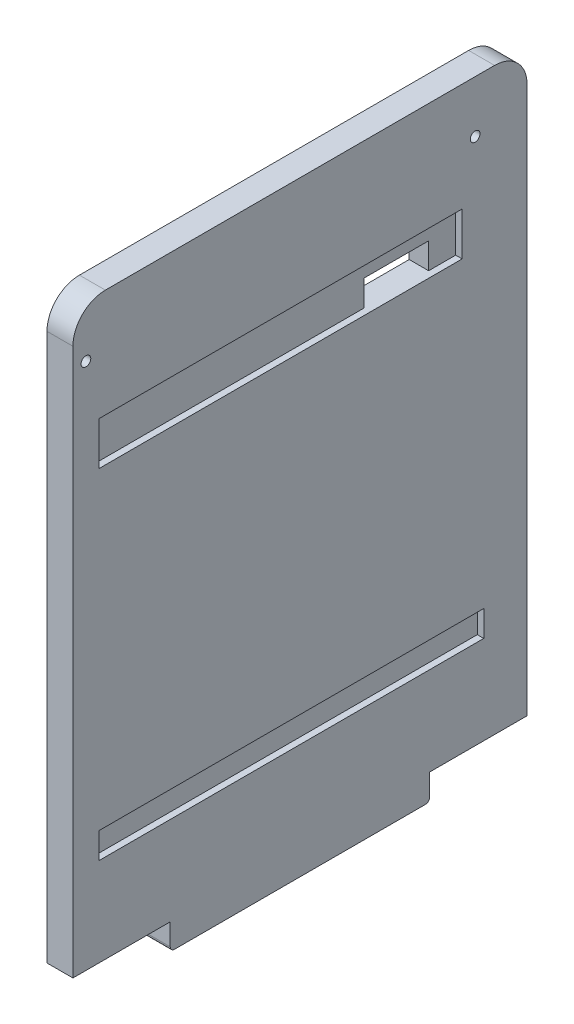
ISO-10303-21;
HEADER;
FILE_DESCRIPTION(('STEP AP214'),'2;1');
FILE_NAME('part.step','',(''),(''),'','','');
FILE_SCHEMA(('AUTOMOTIVE_DESIGN { 1 0 10303 214 1 1 1 1 }'));
ENDSEC;
DATA;
#1=APPLICATION_CONTEXT('core data for automotive mechanical design processes');
#2=APPLICATION_PROTOCOL_DEFINITION('international standard','automotive_design',2000,#1);
#3=PRODUCT_CONTEXT('',#1,'mechanical');
#4=PRODUCT('Part','Part','',(#3));
#5=PRODUCT_RELATED_PRODUCT_CATEGORY('part','',(#4));
#6=PRODUCT_DEFINITION_FORMATION('','',#4);
#7=PRODUCT_DEFINITION_CONTEXT('part definition',#1,'design');
#8=PRODUCT_DEFINITION('design','',#6,#7);
#9=PRODUCT_DEFINITION_SHAPE('','',#8);
#10=(LENGTH_UNIT() NAMED_UNIT(*) SI_UNIT(.MILLI.,.METRE.));
#11=(NAMED_UNIT(*) PLANE_ANGLE_UNIT() SI_UNIT($,.RADIAN.));
#12=(NAMED_UNIT(*) SI_UNIT($,.STERADIAN.) SOLID_ANGLE_UNIT());
#13=UNCERTAINTY_MEASURE_WITH_UNIT(LENGTH_MEASURE(1.E-05),#10,'distance_accuracy_value','');
#14=(GEOMETRIC_REPRESENTATION_CONTEXT(3) GLOBAL_UNCERTAINTY_ASSIGNED_CONTEXT((#13)) GLOBAL_UNIT_ASSIGNED_CONTEXT((#10,
#11,#12)) REPRESENTATION_CONTEXT('',''));
#15=CARTESIAN_POINT('',(0.,0.,0.));
#16=DIRECTION('',(0.,0.,1.));
#17=DIRECTION('',(1.,0.,0.));
#18=AXIS2_PLACEMENT_3D('',#15,#16,#17);
#19=CARTESIAN_POINT('',(48.,265.,-90.));
#20=DIRECTION('',(1.,0.,0.));
#21=DIRECTION('',(0.,0.,-1.));
#22=AXIS2_PLACEMENT_3D('',#19,#20,#21);
#23=PLANE('',#22);
#24=CARTESIAN_POINT('',(48.,256.,-81.));
#25=DIRECTION('',(-1.,0.,0.));
#26=DIRECTION('',(0.,0.,1.));
#27=AXIS2_PLACEMENT_3D('',#24,#25,#26);
#28=CIRCLE('',#27,4.5);
#29=CARTESIAN_POINT('',(48.,256.,-76.5));
#30=VERTEX_POINT('',#29);
#31=EDGE_CURVE('E1182',#30,#30,#28,.T.);
#32=ORIENTED_EDGE('',*,*,#31,.F.);
#33=EDGE_LOOP('',(#32));
#34=FACE_BOUND('',#33,.T.);
#35=CARTESIAN_POINT('',(48.,47.,-98.9999999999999));
#36=DIRECTION('',(-1.,0.,0.));
#37=DIRECTION('',(0.,0.,1.));
#38=AXIS2_PLACEMENT_3D('',#35,#36,#37);
#39=CIRCLE('',#38,1.99999999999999);
#40=CARTESIAN_POINT('',(48.,47.,-96.9999999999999));
#41=VERTEX_POINT('',#40);
#42=EDGE_CURVE('E400',#41,#41,#39,.T.);
#43=ORIENTED_EDGE('',*,*,#42,.F.);
#44=EDGE_LOOP('',(#43));
#45=FACE_BOUND('',#44,.T.);
#46=CARTESIAN_POINT('',(48.,47.,99.));
#47=DIRECTION('',(-1.,0.,0.));
#48=DIRECTION('',(0.,0.,1.));
#49=AXIS2_PLACEMENT_3D('',#46,#47,#48);
#50=CIRCLE('',#49,1.99999999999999);
#51=CARTESIAN_POINT('',(48.,47.,101.));
#52=VERTEX_POINT('',#51);
#53=EDGE_CURVE('E419',#52,#52,#50,.T.);
#54=ORIENTED_EDGE('',*,*,#53,.F.);
#55=EDGE_LOOP('',(#54));
#56=FACE_BOUND('',#55,.T.);
#57=CARTESIAN_POINT('',(48.,216.,-83.9999999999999));
#58=DIRECTION('',(-1.,0.,0.));
#59=DIRECTION('',(0.,0.,1.));
#60=AXIS2_PLACEMENT_3D('',#57,#58,#59);
#61=CIRCLE('',#60,2.);
#62=CARTESIAN_POINT('',(48.,216.,-81.9999999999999));
#63=VERTEX_POINT('',#62);
#64=EDGE_CURVE('E425',#63,#63,#61,.T.);
#65=ORIENTED_EDGE('',*,*,#64,.F.);
#66=EDGE_LOOP('',(#65));
#67=FACE_BOUND('',#66,.T.);
#68=CARTESIAN_POINT('',(48.,24.,-98.9999999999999));
#69=DIRECTION('',(-1.,0.,0.));
#70=DIRECTION('',(0.,0.,1.));
#71=AXIS2_PLACEMENT_3D('',#68,#69,#70);
#72=CIRCLE('',#71,1.99999999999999);
#73=CARTESIAN_POINT('',(48.,24.,-96.9999999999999));
#74=VERTEX_POINT('',#73);
#75=EDGE_CURVE('E431',#74,#74,#72,.T.);
#76=ORIENTED_EDGE('',*,*,#75,.F.);
#77=EDGE_LOOP('',(#76));
#78=FACE_BOUND('',#77,.T.);
#79=CARTESIAN_POINT('',(48.,24.,99.));
#80=DIRECTION('',(-1.,0.,0.));
#81=DIRECTION('',(0.,0.,1.));
#82=AXIS2_PLACEMENT_3D('',#79,#80,#81);
#83=CIRCLE('',#82,1.99999999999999);
#84=CARTESIAN_POINT('',(48.,24.,101.));
#85=VERTEX_POINT('',#84);
#86=EDGE_CURVE('E437',#85,#85,#83,.T.);
#87=ORIENTED_EDGE('',*,*,#86,.F.);
#88=EDGE_LOOP('',(#87));
#89=FACE_BOUND('',#88,.T.);
#90=DIRECTION('',(0.,0.,-1.));
#91=VECTOR('',#90,1.);
#92=CARTESIAN_POINT('',(48.,222.,-32.5));
#93=LINE('',#92,#91);
#94=CARTESIAN_POINT('',(48.,222.,-32.5));
#95=VERTEX_POINT('',#94);
#96=CARTESIAN_POINT('',(48.,222.,-62.5));
#97=VERTEX_POINT('',#96);
#98=EDGE_CURVE('E513',#95,#97,#93,.T.);
#99=ORIENTED_EDGE('',*,*,#98,.F.);
#100=DIRECTION('',(0.,1.,0.));
#101=VECTOR('',#100,1.);
#102=CARTESIAN_POINT('',(48.,210.,-32.5));
#103=LINE('',#102,#101);
#104=CARTESIAN_POINT('',(48.,210.,-32.5));
#105=VERTEX_POINT('',#104);
#106=EDGE_CURVE('E506',#105,#95,#103,.T.);
#107=ORIENTED_EDGE('',*,*,#106,.F.);
#108=DIRECTION('',(0.,0.,1.));
#109=VECTOR('',#108,1.);
#110=CARTESIAN_POINT('',(48.,210.,-62.5));
#111=LINE('',#110,#109);
#112=CARTESIAN_POINT('',(48.,210.,-62.5));
#113=VERTEX_POINT('',#112);
#114=EDGE_CURVE('E519',#113,#105,#111,.T.);
#115=ORIENTED_EDGE('',*,*,#114,.F.);
#116=DIRECTION('',(0.,-1.,0.));
#117=VECTOR('',#116,1.);
#118=CARTESIAN_POINT('',(48.,222.,-62.5));
#119=LINE('',#118,#117);
#120=EDGE_CURVE('E516',#97,#113,#119,.T.);
#121=ORIENTED_EDGE('',*,*,#120,.F.);
#122=EDGE_LOOP('',(#99,#107,#115,#121));
#123=FACE_BOUND('',#122,.T.);
#124=CARTESIAN_POINT('',(48.,112.,-5.00000000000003));
#125=DIRECTION('',(1.,0.,0.));
#126=DIRECTION('',(0.,0.,-1.));
#127=AXIS2_PLACEMENT_3D('',#124,#125,#126);
#128=CIRCLE('',#127,105.);
#129=CARTESIAN_POINT('',(47.9999999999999,112.,100.));
#130=VERTEX_POINT('',#129);
#131=CARTESIAN_POINT('',(48.,217.,-5.00000000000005));
#132=VERTEX_POINT('',#131);
#133=EDGE_CURVE('E352',#130,#132,#128,.F.);
#134=ORIENTED_EDGE('',*,*,#133,.F.);
#135=DIRECTION('',(0.,1.,0.));
#136=VECTOR('',#135,1.);
#137=CARTESIAN_POINT('',(48.,265.,100.));
#138=LINE('',#137,#136);
#139=CARTESIAN_POINT('',(47.9999999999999,55.,100.));
#140=VERTEX_POINT('',#139);
#141=EDGE_CURVE('E350',#140,#130,#138,.T.);
#142=ORIENTED_EDGE('',*,*,#141,.F.);
#143=DIRECTION('',(0.,0.,-1.));
#144=VECTOR('',#143,1.);
#145=CARTESIAN_POINT('',(48.,55.,-90.));
#146=LINE('',#145,#144);
#147=CARTESIAN_POINT('',(47.9999999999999,55.,98.));
#148=VERTEX_POINT('',#147);
#149=EDGE_CURVE('E347',#140,#148,#146,.T.);
#150=ORIENTED_EDGE('',*,*,#149,.T.);
#151=DIRECTION('',(0.,1.,0.));
#152=VECTOR('',#151,1.);
#153=CARTESIAN_POINT('',(48.,265.,98.));
#154=LINE('',#153,#152);
#155=CARTESIAN_POINT('',(47.9999999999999,112.,98.));
#156=VERTEX_POINT('',#155);
#157=EDGE_CURVE('E344',#148,#156,#154,.T.);
#158=ORIENTED_EDGE('',*,*,#157,.T.);
#159=CARTESIAN_POINT('',(48.,112.,-5.00000000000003));
#160=DIRECTION('',(1.,0.,0.));
#161=DIRECTION('',(0.,0.,-1.));
#162=AXIS2_PLACEMENT_3D('',#159,#160,#161);
#163=CIRCLE('',#162,103.);
#164=CARTESIAN_POINT('',(47.9999999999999,215.,-5.00000000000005));
#165=VERTEX_POINT('',#164);
#166=EDGE_CURVE('E341',#156,#165,#163,.F.);
#167=ORIENTED_EDGE('',*,*,#166,.T.);
#168=DIRECTION('',(0.,0.,-1.));
#169=VECTOR('',#168,1.);
#170=CARTESIAN_POINT('',(48.,215.,-90.));
#171=LINE('',#170,#169);
#172=CARTESIAN_POINT('',(47.9999999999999,215.,-15.));
#173=VERTEX_POINT('',#172);
#174=EDGE_CURVE('E338',#165,#173,#171,.T.);
#175=ORIENTED_EDGE('',*,*,#174,.T.);
#176=DIRECTION('',(0.,1.,0.));
#177=VECTOR('',#176,1.);
#178=CARTESIAN_POINT('',(48.,265.,-15.));
#179=LINE('',#178,#177);
#180=CARTESIAN_POINT('',(47.9999999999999,217.,-15.));
#181=VERTEX_POINT('',#180);
#182=EDGE_CURVE('E335',#173,#181,#179,.T.);
#183=ORIENTED_EDGE('',*,*,#182,.T.);
#184=DIRECTION('',(0.,0.,-1.));
#185=VECTOR('',#184,1.);
#186=CARTESIAN_POINT('',(48.,217.,-90.));
#187=LINE('',#186,#185);
#188=EDGE_CURVE('E333',#132,#181,#187,.T.);
#189=ORIENTED_EDGE('',*,*,#188,.F.);
#190=EDGE_LOOP('',(#134,#142,#150,#158,#167,#175,#183,#189));
#191=FACE_BOUND('',#190,.T.);
#192=DIRECTION('',(0.,-1.,0.));
#193=VECTOR('',#192,1.);
#194=CARTESIAN_POINT('',(48.,12.,-60.));
#195=LINE('',#194,#193);
#196=CARTESIAN_POINT('',(48.,12.,-60.));
#197=VERTEX_POINT('',#196);
#198=CARTESIAN_POINT('',(48.,2.,-60.));
#199=VERTEX_POINT('',#198);
#200=EDGE_CURVE('E443',#197,#199,#195,.T.);
#201=ORIENTED_EDGE('',*,*,#200,.T.);
#202=CARTESIAN_POINT('',(48.,2.,-58.));
#203=DIRECTION('',(1.,0.,0.));
#204=DIRECTION('',(0.,0.,-1.));
#205=AXIS2_PLACEMENT_3D('',#202,#203,#204);
#206=CIRCLE('',#205,2.);
#207=CARTESIAN_POINT('',(48.,0.,-58.));
#208=VERTEX_POINT('',#207);
#209=EDGE_CURVE('E390',#199,#208,#206,.F.);
#210=ORIENTED_EDGE('',*,*,#209,.T.);
#211=DIRECTION('',(0.,0.,1.));
#212=VECTOR('',#211,1.);
#213=CARTESIAN_POINT('',(48.,0.,-60.));
#214=LINE('',#213,#212);
#215=CARTESIAN_POINT('',(48.,0.,58.));
#216=VERTEX_POINT('',#215);
#217=EDGE_CURVE('E451',#208,#216,#214,.T.);
#218=ORIENTED_EDGE('',*,*,#217,.T.);
#219=CARTESIAN_POINT('',(48.,2.,58.));
#220=DIRECTION('',(1.,0.,0.));
#221=DIRECTION('',(0.,0.,-1.));
#222=AXIS2_PLACEMENT_3D('',#219,#220,#221);
#223=CIRCLE('',#222,2.);
#224=CARTESIAN_POINT('',(48.,2.,60.));
#225=VERTEX_POINT('',#224);
#226=EDGE_CURVE('E388',#216,#225,#223,.F.);
#227=ORIENTED_EDGE('',*,*,#226,.T.);
#228=DIRECTION('',(0.,1.,0.));
#229=VECTOR('',#228,1.);
#230=CARTESIAN_POINT('',(48.,12.,60.));
#231=LINE('',#230,#229);
#232=CARTESIAN_POINT('',(48.,12.,60.));
#233=VERTEX_POINT('',#232);
#234=EDGE_CURVE('E447',#225,#233,#231,.T.);
#235=ORIENTED_EDGE('',*,*,#234,.T.);
#236=DIRECTION('',(0.,0.,-1.));
#237=VECTOR('',#236,1.);
#238=CARTESIAN_POINT('',(48.,12.,105.));
#239=LINE('',#238,#237);
#240=CARTESIAN_POINT('',(48.,12.,105.));
#241=VERTEX_POINT('',#240);
#242=EDGE_CURVE('E286',#241,#233,#239,.T.);
#243=ORIENTED_EDGE('',*,*,#242,.F.);
#244=DIRECTION('',(0.,-1.,0.));
#245=VECTOR('',#244,1.);
#246=CARTESIAN_POINT('',(48.,265.,105.));
#247=LINE('',#246,#245);
#248=CARTESIAN_POINT('',(48.,265.,105.));
#249=VERTEX_POINT('',#248);
#250=EDGE_CURVE('E310',#249,#241,#247,.T.);
#251=ORIENTED_EDGE('',*,*,#250,.F.);
#252=CARTESIAN_POINT('',(48.,265.,90.));
#253=DIRECTION('',(1.,0.,0.));
#254=DIRECTION('',(0.,0.,-1.));
#255=AXIS2_PLACEMENT_3D('',#252,#253,#254);
#256=CIRCLE('',#255,15.);
#257=CARTESIAN_POINT('',(48.,280.,90.));
#258=VERTEX_POINT('',#257);
#259=EDGE_CURVE('E308',#258,#249,#256,.T.);
#260=ORIENTED_EDGE('',*,*,#259,.F.);
#261=DIRECTION('',(0.,0.,1.));
#262=VECTOR('',#261,1.);
#263=CARTESIAN_POINT('',(48.,280.,-90.));
#264=LINE('',#263,#262);
#265=CARTESIAN_POINT('',(48.,280.,-90.));
#266=VERTEX_POINT('',#265);
#267=EDGE_CURVE('E305',#266,#258,#264,.T.);
#268=ORIENTED_EDGE('',*,*,#267,.F.);
#269=CARTESIAN_POINT('',(48.,265.,-90.));
#270=DIRECTION('',(1.,0.,0.));
#271=DIRECTION('',(0.,0.,-1.));
#272=AXIS2_PLACEMENT_3D('',#269,#270,#271);
#273=CIRCLE('',#272,15.);
#274=CARTESIAN_POINT('',(48.,265.,-105.));
#275=VERTEX_POINT('',#274);
#276=EDGE_CURVE('E302',#275,#266,#273,.T.);
#277=ORIENTED_EDGE('',*,*,#276,.F.);
#278=DIRECTION('',(0.,1.,0.));
#279=VECTOR('',#278,1.);
#280=CARTESIAN_POINT('',(48.,12.,-105.));
#281=LINE('',#280,#279);
#282=CARTESIAN_POINT('',(48.,12.,-105.));
#283=VERTEX_POINT('',#282);
#284=EDGE_CURVE('E314',#283,#275,#281,.T.);
#285=ORIENTED_EDGE('',*,*,#284,.F.);
#286=EDGE_CURVE('E312',#197,#283,#239,.T.);
#287=ORIENTED_EDGE('',*,*,#286,.F.);
#288=EDGE_LOOP('',(#201,#210,#218,#227,#235,#243,#251,#260,#268,#277,#285,#287));
#289=FACE_BOUND('',#288,.T.);
#290=DIRECTION('',(0.,-0.110431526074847,0.993883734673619));
#291=VECTOR('',#290,1.);
#292=CARTESIAN_POINT('',(48.,38.7926829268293,-115.134146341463));
#293=LINE('',#292,#291);
#294=CARTESIAN_POINT('',(48.,37.,-98.9999999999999));
#295=VERTEX_POINT('',#294);
#296=CARTESIAN_POINT('',(48.,15.,99.));
#297=VERTEX_POINT('',#296);
#298=EDGE_CURVE('E364',#295,#297,#293,.T.);
#299=ORIENTED_EDGE('',*,*,#298,.F.);
#300=DIRECTION('',(0.,0.993883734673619,0.110431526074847));
#301=VECTOR('',#300,1.);
#302=CARTESIAN_POINT('',(48.,263.207317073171,-73.8658536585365));
#303=LINE('',#302,#301);
#304=CARTESIAN_POINT('',(48.,39.9816512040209,-98.6687054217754));
#305=VERTEX_POINT('',#304);
#306=EDGE_CURVE('E361',#295,#305,#303,.T.);
#307=ORIENTED_EDGE('',*,*,#306,.T.);
#308=DIRECTION('',(0.,-0.110431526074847,0.993883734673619));
#309=VECTOR('',#308,1.);
#310=CARTESIAN_POINT('',(48.,41.7743341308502,-114.802851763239));
#311=LINE('',#310,#309);
#312=CARTESIAN_POINT('',(48.,17.9816512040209,99.3312945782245));
#313=VERTEX_POINT('',#312);
#314=EDGE_CURVE('E355',#305,#313,#311,.T.);
#315=ORIENTED_EDGE('',*,*,#314,.T.);
#316=DIRECTION('',(0.,-0.993883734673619,-0.110431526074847));
#317=VECTOR('',#316,1.);
#318=CARTESIAN_POINT('',(48.,241.207317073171,124.134146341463));
#319=LINE('',#318,#317);
#320=EDGE_CURVE('E358',#313,#297,#319,.T.);
#321=ORIENTED_EDGE('',*,*,#320,.T.);
#322=EDGE_LOOP('',(#299,#307,#315,#321));
#323=FACE_BOUND('',#322,.T.);
#324=CARTESIAN_POINT('',(48.,256.,99.));
#325=DIRECTION('',(-1.,0.,0.));
#326=DIRECTION('',(0.,0.,1.));
#327=AXIS2_PLACEMENT_3D('',#324,#325,#326);
#328=CIRCLE('',#327,4.5);
#329=CARTESIAN_POINT('',(48.,256.,103.5));
#330=VERTEX_POINT('',#329);
#331=EDGE_CURVE('E413',#330,#330,#328,.T.);
#332=ORIENTED_EDGE('',*,*,#331,.F.);
#333=EDGE_LOOP('',(#332));
#334=FACE_BOUND('',#333,.T.);
#335=ADVANCED_FACE('F39',(#34,#45,#56,#67,#78,#89,#123,#191,#289,#323,#334),#23,.F.);
#336=CARTESIAN_POINT('',(60.,12.,105.));
#337=DIRECTION('',(0.,1.,0.));
#338=DIRECTION('',(0.,0.,1.));
#339=AXIS2_PLACEMENT_3D('',#336,#337,#338);
#340=PLANE('',#339);
#341=DIRECTION('',(-1.,0.,0.));
#342=VECTOR('',#341,1.);
#343=CARTESIAN_POINT('',(60.,12.,60.));
#344=LINE('',#343,#342);
#345=CARTESIAN_POINT('',(60.,12.,60.));
#346=VERTEX_POINT('',#345);
#347=EDGE_CURVE('E275',#346,#233,#344,.T.);
#348=ORIENTED_EDGE('',*,*,#347,.F.);
#349=DIRECTION('',(0.,0.,-1.));
#350=VECTOR('',#349,1.);
#351=CARTESIAN_POINT('',(60.,12.,105.));
#352=LINE('',#351,#350);
#353=CARTESIAN_POINT('',(60.,12.,105.));
#354=VERTEX_POINT('',#353);
#355=EDGE_CURVE('E284',#354,#346,#352,.T.);
#356=ORIENTED_EDGE('',*,*,#355,.F.);
#357=DIRECTION('',(-1.,0.,0.));
#358=VECTOR('',#357,1.);
#359=CARTESIAN_POINT('',(60.,12.,105.));
#360=LINE('',#359,#358);
#361=EDGE_CURVE('E322',#354,#241,#360,.T.);
#362=ORIENTED_EDGE('',*,*,#361,.T.);
#363=ORIENTED_EDGE('',*,*,#242,.T.);
#364=EDGE_LOOP('',(#348,#356,#362,#363));
#365=FACE_BOUND('',#364,.T.);
#366=ADVANCED_FACE('F282',(#365),#340,.F.);
#367=CARTESIAN_POINT('',(60.,265.,-90.));
#368=DIRECTION('',(1.,0.,0.));
#369=DIRECTION('',(0.,0.,-1.));
#370=AXIS2_PLACEMENT_3D('',#367,#368,#369);
#371=PLANE('',#370);
#372=CARTESIAN_POINT('',(60.,256.,-81.));
#373=DIRECTION('',(1.,0.,0.));
#374=DIRECTION('',(0.,0.,-1.));
#375=AXIS2_PLACEMENT_3D('',#372,#373,#374);
#376=CIRCLE('',#375,2.24999999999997);
#377=CARTESIAN_POINT('',(60.,256.,-83.25));
#378=VERTEX_POINT('',#377);
#379=EDGE_CURVE('E43',#378,#378,#376,.T.);
#380=ORIENTED_EDGE('',*,*,#379,.F.);
#381=EDGE_LOOP('',(#380));
#382=FACE_BOUND('',#381,.T.);
#383=CARTESIAN_POINT('',(60.,256.,99.));
#384=DIRECTION('',(1.,0.,0.));
#385=DIRECTION('',(0.,0.,-1.));
#386=AXIS2_PLACEMENT_3D('',#383,#384,#385);
#387=CIRCLE('',#386,2.24999999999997);
#388=CARTESIAN_POINT('',(60.,256.,96.75));
#389=VERTEX_POINT('',#388);
#390=EDGE_CURVE('E398',#389,#389,#387,.T.);
#391=ORIENTED_EDGE('',*,*,#390,.F.);
#392=EDGE_LOOP('',(#391));
#393=FACE_BOUND('',#392,.T.);
#394=DIRECTION('',(0.,1.,0.));
#395=VECTOR('',#394,1.);
#396=CARTESIAN_POINT('',(60.,53.,-85.));
#397=LINE('',#396,#395);
#398=CARTESIAN_POINT('',(60.,53.,-85.));
#399=VERTEX_POINT('',#398);
#400=CARTESIAN_POINT('',(60.,65.,-85.));
#401=VERTEX_POINT('',#400);
#402=EDGE_CURVE('E496',#399,#401,#397,.T.);
#403=ORIENTED_EDGE('',*,*,#402,.F.);
#404=DIRECTION('',(0.,0.,1.));
#405=VECTOR('',#404,1.);
#406=CARTESIAN_POINT('',(60.,53.,-90.));
#407=LINE('',#406,#405);
#408=CARTESIAN_POINT('',(60.,53.,93.));
#409=VERTEX_POINT('',#408);
#410=EDGE_CURVE('E372',#399,#409,#407,.T.);
#411=ORIENTED_EDGE('',*,*,#410,.T.);
#412=DIRECTION('',(0.,-1.,0.));
#413=VECTOR('',#412,1.);
#414=CARTESIAN_POINT('',(60.,265.,93.));
#415=LINE('',#414,#413);
#416=CARTESIAN_POINT('',(60.,65.,93.));
#417=VERTEX_POINT('',#416);
#418=EDGE_CURVE('E370',#417,#409,#415,.T.);
#419=ORIENTED_EDGE('',*,*,#418,.F.);
#420=DIRECTION('',(0.,0.,1.));
#421=VECTOR('',#420,1.);
#422=CARTESIAN_POINT('',(60.,65.,-90.));
#423=LINE('',#422,#421);
#424=EDGE_CURVE('E368',#401,#417,#423,.T.);
#425=ORIENTED_EDGE('',*,*,#424,.F.);
#426=EDGE_LOOP('',(#403,#411,#419,#425));
#427=FACE_BOUND('',#426,.T.);
#428=DIRECTION('',(0.,0.,1.));
#429=VECTOR('',#428,1.);
#430=CARTESIAN_POINT('',(60.,0.,-60.));
#431=LINE('',#430,#429);
#432=CARTESIAN_POINT('',(60.,0.,-58.));
#433=VERTEX_POINT('',#432);
#434=CARTESIAN_POINT('',(60.,0.,58.));
#435=VERTEX_POINT('',#434);
#436=EDGE_CURVE('E278',#433,#435,#431,.T.);
#437=ORIENTED_EDGE('',*,*,#436,.F.);
#438=CARTESIAN_POINT('',(60.,2.,-58.));
#439=DIRECTION('',(1.,0.,0.));
#440=DIRECTION('',(0.,0.,-1.));
#441=AXIS2_PLACEMENT_3D('',#438,#439,#440);
#442=CIRCLE('',#441,2.);
#443=CARTESIAN_POINT('',(60.,2.,-60.));
#444=VERTEX_POINT('',#443);
#445=EDGE_CURVE('E48',#433,#444,#442,.T.);
#446=ORIENTED_EDGE('',*,*,#445,.T.);
#447=DIRECTION('',(0.,-1.,0.));
#448=VECTOR('',#447,1.);
#449=CARTESIAN_POINT('',(60.,12.,-60.));
#450=LINE('',#449,#448);
#451=CARTESIAN_POINT('',(60.,12.,-60.));
#452=VERTEX_POINT('',#451);
#453=EDGE_CURVE('E444',#452,#444,#450,.T.);
#454=ORIENTED_EDGE('',*,*,#453,.F.);
#455=CARTESIAN_POINT('',(60.,12.,-105.));
#456=VERTEX_POINT('',#455);
#457=EDGE_CURVE('E295',#452,#456,#352,.T.);
#458=ORIENTED_EDGE('',*,*,#457,.T.);
#459=DIRECTION('',(0.,1.,0.));
#460=VECTOR('',#459,1.);
#461=CARTESIAN_POINT('',(60.,12.,-105.));
#462=LINE('',#461,#460);
#463=CARTESIAN_POINT('',(60.,265.,-105.));
#464=VERTEX_POINT('',#463);
#465=EDGE_CURVE('E294',#456,#464,#462,.T.);
#466=ORIENTED_EDGE('',*,*,#465,.T.);
#467=CARTESIAN_POINT('',(60.,265.,-90.));
#468=DIRECTION('',(1.,0.,0.));
#469=DIRECTION('',(0.,0.,-1.));
#470=AXIS2_PLACEMENT_3D('',#467,#468,#469);
#471=CIRCLE('',#470,15.);
#472=CARTESIAN_POINT('',(60.,280.,-90.));
#473=VERTEX_POINT('',#472);
#474=EDGE_CURVE('E316',#464,#473,#471,.T.);
#475=ORIENTED_EDGE('',*,*,#474,.T.);
#476=DIRECTION('',(0.,0.,1.));
#477=VECTOR('',#476,1.);
#478=CARTESIAN_POINT('',(60.,280.,-90.));
#479=LINE('',#478,#477);
#480=CARTESIAN_POINT('',(60.,280.,90.));
#481=VERTEX_POINT('',#480);
#482=EDGE_CURVE('E592',#473,#481,#479,.T.);
#483=ORIENTED_EDGE('',*,*,#482,.T.);
#484=CARTESIAN_POINT('',(60.,265.,90.));
#485=DIRECTION('',(1.,0.,0.));
#486=DIRECTION('',(0.,0.,-1.));
#487=AXIS2_PLACEMENT_3D('',#484,#485,#486);
#488=CIRCLE('',#487,15.);
#489=CARTESIAN_POINT('',(60.,265.,105.));
#490=VERTEX_POINT('',#489);
#491=EDGE_CURVE('E593',#481,#490,#488,.T.);
#492=ORIENTED_EDGE('',*,*,#491,.T.);
#493=DIRECTION('',(0.,-1.,0.));
#494=VECTOR('',#493,1.);
#495=CARTESIAN_POINT('',(60.,265.,105.));
#496=LINE('',#495,#494);
#497=EDGE_CURVE('E292',#490,#354,#496,.T.);
#498=ORIENTED_EDGE('',*,*,#497,.T.);
#499=ORIENTED_EDGE('',*,*,#355,.T.);
#500=DIRECTION('',(0.,1.,0.));
#501=VECTOR('',#500,1.);
#502=CARTESIAN_POINT('',(60.,12.,60.));
#503=LINE('',#502,#501);
#504=CARTESIAN_POINT('',(60.,2.,60.));
#505=VERTEX_POINT('',#504);
#506=EDGE_CURVE('E272',#505,#346,#503,.T.);
#507=ORIENTED_EDGE('',*,*,#506,.F.);
#508=CARTESIAN_POINT('',(60.,2.,58.));
#509=DIRECTION('',(1.,0.,0.));
#510=DIRECTION('',(0.,0.,-1.));
#511=AXIS2_PLACEMENT_3D('',#508,#509,#510);
#512=CIRCLE('',#511,2.);
#513=EDGE_CURVE('E61',#505,#435,#512,.T.);
#514=ORIENTED_EDGE('',*,*,#513,.T.);
#515=EDGE_LOOP('',(#437,#446,#454,#458,#466,#475,#483,#492,#498,#499,#507,#514));
#516=FACE_BOUND('',#515,.T.);
#517=DIRECTION('',(0.,1.,0.));
#518=VECTOR('',#517,1.);
#519=CARTESIAN_POINT('',(60.,265.,-75.));
#520=LINE('',#519,#518);
#521=CARTESIAN_POINT('',(60.,210.,-75.));
#522=VERTEX_POINT('',#521);
#523=CARTESIAN_POINT('',(60.,230.,-75.));
#524=VERTEX_POINT('',#523);
#525=EDGE_CURVE('E383',#522,#524,#520,.T.);
#526=ORIENTED_EDGE('',*,*,#525,.F.);
#527=DIRECTION('',(0.,0.,-1.));
#528=VECTOR('',#527,1.);
#529=CARTESIAN_POINT('',(60.,210.,-90.));
#530=LINE('',#529,#528);
#531=CARTESIAN_POINT('',(60.,210.,93.));
#532=VERTEX_POINT('',#531);
#533=EDGE_CURVE('E366',#532,#522,#530,.T.);
#534=ORIENTED_EDGE('',*,*,#533,.F.);
#535=DIRECTION('',(0.,-1.,0.));
#536=VECTOR('',#535,1.);
#537=CARTESIAN_POINT('',(60.,265.,93.));
#538=LINE('',#537,#536);
#539=CARTESIAN_POINT('',(60.,230.,93.));
#540=VERTEX_POINT('',#539);
#541=EDGE_CURVE('E380',#540,#532,#538,.T.);
#542=ORIENTED_EDGE('',*,*,#541,.F.);
#543=DIRECTION('',(0.,0.,1.));
#544=VECTOR('',#543,1.);
#545=CARTESIAN_POINT('',(60.,230.,-90.));
#546=LINE('',#545,#544);
#547=EDGE_CURVE('E378',#524,#540,#546,.T.);
#548=ORIENTED_EDGE('',*,*,#547,.F.);
#549=EDGE_LOOP('',(#526,#534,#542,#548));
#550=FACE_BOUND('',#549,.T.);
#551=ADVANCED_FACE('F289',(#382,#393,#427,#516,#550),#371,.T.);
#552=CARTESIAN_POINT('',(60.,265.,-90.));
#553=DIRECTION('',(-1.,0.,0.));
#554=DIRECTION('',(0.,0.,1.));
#555=AXIS2_PLACEMENT_3D('',#552,#553,#554);
#556=CYLINDRICAL_SURFACE('',#555,15.);
#557=ORIENTED_EDGE('',*,*,#276,.T.);
#558=DIRECTION('',(-1.,0.,0.));
#559=VECTOR('',#558,1.);
#560=CARTESIAN_POINT('',(60.,280.,-90.));
#561=LINE('',#560,#559);
#562=EDGE_CURVE('E330',#473,#266,#561,.T.);
#563=ORIENTED_EDGE('',*,*,#562,.F.);
#564=ORIENTED_EDGE('',*,*,#474,.F.);
#565=DIRECTION('',(-1.,0.,0.));
#566=VECTOR('',#565,1.);
#567=CARTESIAN_POINT('',(60.,265.,-105.));
#568=LINE('',#567,#566);
#569=EDGE_CURVE('E297',#464,#275,#568,.T.);
#570=ORIENTED_EDGE('',*,*,#569,.T.);
#571=EDGE_LOOP('',(#557,#563,#564,#570));
#572=FACE_BOUND('',#571,.T.);
#573=ADVANCED_FACE('F631',(#572),#556,.T.);
#574=CARTESIAN_POINT('',(60.,280.,-90.));
#575=DIRECTION('',(0.,-1.,0.));
#576=DIRECTION('',(0.,0.,-1.));
#577=AXIS2_PLACEMENT_3D('',#574,#575,#576);
#578=PLANE('',#577);
#579=ORIENTED_EDGE('',*,*,#267,.T.);
#580=DIRECTION('',(-1.,0.,0.));
#581=VECTOR('',#580,1.);
#582=CARTESIAN_POINT('',(60.,280.,90.));
#583=LINE('',#582,#581);
#584=EDGE_CURVE('E327',#481,#258,#583,.T.);
#585=ORIENTED_EDGE('',*,*,#584,.F.);
#586=ORIENTED_EDGE('',*,*,#482,.F.);
#587=ORIENTED_EDGE('',*,*,#562,.T.);
#588=EDGE_LOOP('',(#579,#585,#586,#587));
#589=FACE_BOUND('',#588,.T.);
#590=ADVANCED_FACE('F634',(#589),#578,.F.);
#591=CARTESIAN_POINT('',(60.,265.,90.));
#592=DIRECTION('',(-1.,0.,0.));
#593=DIRECTION('',(0.,0.,1.));
#594=AXIS2_PLACEMENT_3D('',#591,#592,#593);
#595=CYLINDRICAL_SURFACE('',#594,15.);
#596=ORIENTED_EDGE('',*,*,#259,.T.);
#597=DIRECTION('',(-1.,0.,0.));
#598=VECTOR('',#597,1.);
#599=CARTESIAN_POINT('',(60.,265.,105.));
#600=LINE('',#599,#598);
#601=EDGE_CURVE('E324',#490,#249,#600,.T.);
#602=ORIENTED_EDGE('',*,*,#601,.F.);
#603=ORIENTED_EDGE('',*,*,#491,.F.);
#604=ORIENTED_EDGE('',*,*,#584,.T.);
#605=EDGE_LOOP('',(#596,#602,#603,#604));
#606=FACE_BOUND('',#605,.T.);
#607=ADVANCED_FACE('F598',(#606),#595,.T.);
#608=CARTESIAN_POINT('',(60.,265.,105.));
#609=DIRECTION('',(0.,0.,-1.));
#610=DIRECTION('',(-1.,0.,0.));
#611=AXIS2_PLACEMENT_3D('',#608,#609,#610);
#612=PLANE('',#611);
#613=ORIENTED_EDGE('',*,*,#250,.T.);
#614=ORIENTED_EDGE('',*,*,#361,.F.);
#615=ORIENTED_EDGE('',*,*,#497,.F.);
#616=ORIENTED_EDGE('',*,*,#601,.T.);
#617=EDGE_LOOP('',(#613,#614,#615,#616));
#618=FACE_BOUND('',#617,.T.);
#619=ADVANCED_FACE('F602',(#618),#612,.F.);
#620=ORIENTED_EDGE('',*,*,#457,.F.);
#621=DIRECTION('',(-1.,0.,0.));
#622=VECTOR('',#621,1.);
#623=CARTESIAN_POINT('',(60.,12.,-60.));
#624=LINE('',#623,#622);
#625=EDGE_CURVE('E287',#452,#197,#624,.T.);
#626=ORIENTED_EDGE('',*,*,#625,.T.);
#627=ORIENTED_EDGE('',*,*,#286,.T.);
#628=DIRECTION('',(-1.,0.,0.));
#629=VECTOR('',#628,1.);
#630=CARTESIAN_POINT('',(60.,12.,-105.));
#631=LINE('',#630,#629);
#632=EDGE_CURVE('E319',#456,#283,#631,.T.);
#633=ORIENTED_EDGE('',*,*,#632,.F.);
#634=EDGE_LOOP('',(#620,#626,#627,#633));
#635=FACE_BOUND('',#634,.T.);
#636=ADVANCED_FACE('F622',(#635),#340,.F.);
#637=CARTESIAN_POINT('',(60.,12.,-105.));
#638=DIRECTION('',(0.,0.,1.));
#639=DIRECTION('',(1.,0.,0.));
#640=AXIS2_PLACEMENT_3D('',#637,#638,#639);
#641=PLANE('',#640);
#642=ORIENTED_EDGE('',*,*,#284,.T.);
#643=ORIENTED_EDGE('',*,*,#569,.F.);
#644=ORIENTED_EDGE('',*,*,#465,.F.);
#645=ORIENTED_EDGE('',*,*,#632,.T.);
#646=EDGE_LOOP('',(#642,#643,#644,#645));
#647=FACE_BOUND('',#646,.T.);
#648=ADVANCED_FACE('F627',(#647),#641,.F.);
#649=CARTESIAN_POINT('',(-438.668064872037,112.,-5.00000000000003));
#650=DIRECTION('',(1.,0.,0.));
#651=DIRECTION('',(0.,0.,-1.));
#652=AXIS2_PLACEMENT_3D('',#649,#650,#651);
#653=CYLINDRICAL_SURFACE('',#652,105.);
#654=ORIENTED_EDGE('',*,*,#133,.T.);
#655=DIRECTION('',(1.,0.,0.));
#656=VECTOR('',#655,1.);
#657=CARTESIAN_POINT('',(-438.668064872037,217.,-5.00000000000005));
#658=LINE('',#657,#656);
#659=CARTESIAN_POINT('',(51.,217.,-5.00000000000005));
#660=VERTEX_POINT('',#659);
#661=EDGE_CURVE('E575',#132,#660,#658,.T.);
#662=ORIENTED_EDGE('',*,*,#661,.T.);
#663=CARTESIAN_POINT('',(51.,112.,-5.00000000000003));
#664=DIRECTION('',(1.,0.,0.));
#665=DIRECTION('',(0.,0.,-1.));
#666=AXIS2_PLACEMENT_3D('',#663,#664,#665);
#667=CIRCLE('',#666,105.);
#668=CARTESIAN_POINT('',(51.,112.,100.));
#669=VERTEX_POINT('',#668);
#670=EDGE_CURVE('E568',#669,#660,#667,.F.);
#671=ORIENTED_EDGE('',*,*,#670,.F.);
#672=DIRECTION('',(1.,0.,0.));
#673=VECTOR('',#672,1.);
#674=CARTESIAN_POINT('',(-438.668064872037,112.,100.));
#675=LINE('',#674,#673);
#676=EDGE_CURVE('E577',#130,#669,#675,.T.);
#677=ORIENTED_EDGE('',*,*,#676,.F.);
#678=EDGE_LOOP('',(#654,#662,#671,#677));
#679=FACE_BOUND('',#678,.T.);
#680=ADVANCED_FACE('F656',(#679),#653,.F.);
#681=CARTESIAN_POINT('',(-438.668064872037,55.,100.));
#682=DIRECTION('',(0.,0.,-1.));
#683=DIRECTION('',(-1.,0.,0.));
#684=AXIS2_PLACEMENT_3D('',#681,#682,#683);
#685=PLANE('',#684);
#686=ORIENTED_EDGE('',*,*,#141,.T.);
#687=ORIENTED_EDGE('',*,*,#676,.T.);
#688=DIRECTION('',(0.,1.,0.));
#689=VECTOR('',#688,1.);
#690=CARTESIAN_POINT('',(51.,55.,100.));
#691=LINE('',#690,#689);
#692=CARTESIAN_POINT('',(51.,55.,100.));
#693=VERTEX_POINT('',#692);
#694=EDGE_CURVE('E565',#693,#669,#691,.T.);
#695=ORIENTED_EDGE('',*,*,#694,.F.);
#696=DIRECTION('',(1.,0.,0.));
#697=VECTOR('',#696,1.);
#698=CARTESIAN_POINT('',(-438.668064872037,55.,100.));
#699=LINE('',#698,#697);
#700=EDGE_CURVE('E579',#140,#693,#699,.T.);
#701=ORIENTED_EDGE('',*,*,#700,.F.);
#702=EDGE_LOOP('',(#686,#687,#695,#701));
#703=FACE_BOUND('',#702,.T.);
#704=ADVANCED_FACE('F681',(#703),#685,.T.);
#705=CARTESIAN_POINT('',(-438.668064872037,55.,100.));
#706=DIRECTION('',(0.,-1.,0.));
#707=DIRECTION('',(0.,0.,-1.));
#708=AXIS2_PLACEMENT_3D('',#705,#706,#707);
#709=PLANE('',#708);
#710=ORIENTED_EDGE('',*,*,#700,.T.);
#711=DIRECTION('',(0.,0.,-1.));
#712=VECTOR('',#711,1.);
#713=CARTESIAN_POINT('',(51.,55.,100.));
#714=LINE('',#713,#712);
#715=CARTESIAN_POINT('',(51.,55.,98.));
#716=VERTEX_POINT('',#715);
#717=EDGE_CURVE('E562',#693,#716,#714,.T.);
#718=ORIENTED_EDGE('',*,*,#717,.T.);
#719=DIRECTION('',(1.,0.,0.));
#720=VECTOR('',#719,1.);
#721=CARTESIAN_POINT('',(-438.668064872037,55.,98.));
#722=LINE('',#721,#720);
#723=EDGE_CURVE('E581',#148,#716,#722,.T.);
#724=ORIENTED_EDGE('',*,*,#723,.F.);
#725=ORIENTED_EDGE('',*,*,#149,.F.);
#726=EDGE_LOOP('',(#710,#718,#724,#725));
#727=FACE_BOUND('',#726,.T.);
#728=ADVANCED_FACE('F690',(#727),#709,.F.);
#729=CARTESIAN_POINT('',(-438.668064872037,55.,98.));
#730=DIRECTION('',(0.,0.,-1.));
#731=DIRECTION('',(-1.,0.,0.));
#732=AXIS2_PLACEMENT_3D('',#729,#730,#731);
#733=PLANE('',#732);
#734=ORIENTED_EDGE('',*,*,#723,.T.);
#735=DIRECTION('',(0.,1.,0.));
#736=VECTOR('',#735,1.);
#737=CARTESIAN_POINT('',(51.,55.,98.));
#738=LINE('',#737,#736);
#739=CARTESIAN_POINT('',(51.,112.,98.));
#740=VERTEX_POINT('',#739);
#741=EDGE_CURVE('E559',#716,#740,#738,.T.);
#742=ORIENTED_EDGE('',*,*,#741,.T.);
#743=DIRECTION('',(1.,0.,0.));
#744=VECTOR('',#743,1.);
#745=CARTESIAN_POINT('',(-438.668064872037,112.,98.));
#746=LINE('',#745,#744);
#747=EDGE_CURVE('E583',#156,#740,#746,.T.);
#748=ORIENTED_EDGE('',*,*,#747,.F.);
#749=ORIENTED_EDGE('',*,*,#157,.F.);
#750=EDGE_LOOP('',(#734,#742,#748,#749));
#751=FACE_BOUND('',#750,.T.);
#752=ADVANCED_FACE('F699',(#751),#733,.F.);
#753=CARTESIAN_POINT('',(-438.668064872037,112.,-5.00000000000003));
#754=DIRECTION('',(1.,0.,0.));
#755=DIRECTION('',(0.,0.,-1.));
#756=AXIS2_PLACEMENT_3D('',#753,#754,#755);
#757=CYLINDRICAL_SURFACE('',#756,103.);
#758=ORIENTED_EDGE('',*,*,#747,.T.);
#759=CARTESIAN_POINT('',(51.,112.,-5.00000000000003));
#760=DIRECTION('',(1.,0.,0.));
#761=DIRECTION('',(0.,0.,-1.));
#762=AXIS2_PLACEMENT_3D('',#759,#760,#761);
#763=CIRCLE('',#762,103.);
#764=CARTESIAN_POINT('',(51.,215.,-5.00000000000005));
#765=VERTEX_POINT('',#764);
#766=EDGE_CURVE('E556',#740,#765,#763,.F.);
#767=ORIENTED_EDGE('',*,*,#766,.T.);
#768=DIRECTION('',(1.,0.,0.));
#769=VECTOR('',#768,1.);
#770=CARTESIAN_POINT('',(-438.668064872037,215.,-5.00000000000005));
#771=LINE('',#770,#769);
#772=EDGE_CURVE('E585',#165,#765,#771,.T.);
#773=ORIENTED_EDGE('',*,*,#772,.F.);
#774=ORIENTED_EDGE('',*,*,#166,.F.);
#775=EDGE_LOOP('',(#758,#767,#773,#774));
#776=FACE_BOUND('',#775,.T.);
#777=ADVANCED_FACE('F708',(#776),#757,.T.);
#778=CARTESIAN_POINT('',(-438.668064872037,215.,-5.00000000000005));
#779=DIRECTION('',(0.,-1.,0.));
#780=DIRECTION('',(0.,0.,-1.));
#781=AXIS2_PLACEMENT_3D('',#778,#779,#780);
#782=PLANE('',#781);
#783=ORIENTED_EDGE('',*,*,#772,.T.);
#784=DIRECTION('',(0.,0.,-1.));
#785=VECTOR('',#784,1.);
#786=CARTESIAN_POINT('',(51.,215.,-5.00000000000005));
#787=LINE('',#786,#785);
#788=CARTESIAN_POINT('',(51.,215.,-15.));
#789=VERTEX_POINT('',#788);
#790=EDGE_CURVE('E552',#765,#789,#787,.T.);
#791=ORIENTED_EDGE('',*,*,#790,.T.);
#792=DIRECTION('',(1.,0.,0.));
#793=VECTOR('',#792,1.);
#794=CARTESIAN_POINT('',(-438.668064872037,215.,-15.));
#795=LINE('',#794,#793);
#796=EDGE_CURVE('E587',#173,#789,#795,.T.);
#797=ORIENTED_EDGE('',*,*,#796,.F.);
#798=ORIENTED_EDGE('',*,*,#174,.F.);
#799=EDGE_LOOP('',(#783,#791,#797,#798));
#800=FACE_BOUND('',#799,.T.);
#801=ADVANCED_FACE('F717',(#800),#782,.F.);
#802=CARTESIAN_POINT('',(-438.668064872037,215.,-15.));
#803=DIRECTION('',(0.,0.,-1.));
#804=DIRECTION('',(-1.,0.,0.));
#805=AXIS2_PLACEMENT_3D('',#802,#803,#804);
#806=PLANE('',#805);
#807=ORIENTED_EDGE('',*,*,#796,.T.);
#808=DIRECTION('',(0.,1.,0.));
#809=VECTOR('',#808,1.);
#810=CARTESIAN_POINT('',(51.,215.,-15.));
#811=LINE('',#810,#809);
#812=CARTESIAN_POINT('',(51.,217.,-15.));
#813=VERTEX_POINT('',#812);
#814=EDGE_CURVE('E555',#789,#813,#811,.T.);
#815=ORIENTED_EDGE('',*,*,#814,.T.);
#816=DIRECTION('',(1.,0.,0.));
#817=VECTOR('',#816,1.);
#818=CARTESIAN_POINT('',(-438.668064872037,217.,-15.));
#819=LINE('',#818,#817);
#820=EDGE_CURVE('E306',#181,#813,#819,.T.);
#821=ORIENTED_EDGE('',*,*,#820,.F.);
#822=ORIENTED_EDGE('',*,*,#182,.F.);
#823=EDGE_LOOP('',(#807,#815,#821,#822));
#824=FACE_BOUND('',#823,.T.);
#825=ADVANCED_FACE('F726',(#824),#806,.F.);
#826=CARTESIAN_POINT('',(-438.668064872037,217.,-5.00000000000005));
#827=DIRECTION('',(0.,-1.,0.));
#828=DIRECTION('',(0.,0.,-1.));
#829=AXIS2_PLACEMENT_3D('',#826,#827,#828);
#830=PLANE('',#829);
#831=ORIENTED_EDGE('',*,*,#188,.T.);
#832=ORIENTED_EDGE('',*,*,#820,.T.);
#833=DIRECTION('',(0.,0.,-1.));
#834=VECTOR('',#833,1.);
#835=CARTESIAN_POINT('',(51.,217.,-5.00000000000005));
#836=LINE('',#835,#834);
#837=EDGE_CURVE('E549',#660,#813,#836,.T.);
#838=ORIENTED_EDGE('',*,*,#837,.F.);
#839=ORIENTED_EDGE('',*,*,#661,.F.);
#840=EDGE_LOOP('',(#831,#832,#838,#839));
#841=FACE_BOUND('',#840,.T.);
#842=ADVANCED_FACE('F735',(#841),#830,.T.);
#843=CARTESIAN_POINT('',(51.,265.,-90.));
#844=DIRECTION('',(1.,0.,0.));
#845=DIRECTION('',(0.,0.,-1.));
#846=AXIS2_PLACEMENT_3D('',#843,#844,#845);
#847=PLANE('',#846);
#848=ORIENTED_EDGE('',*,*,#837,.T.);
#849=ORIENTED_EDGE('',*,*,#814,.F.);
#850=ORIENTED_EDGE('',*,*,#790,.F.);
#851=ORIENTED_EDGE('',*,*,#766,.F.);
#852=ORIENTED_EDGE('',*,*,#741,.F.);
#853=ORIENTED_EDGE('',*,*,#717,.F.);
#854=ORIENTED_EDGE('',*,*,#694,.T.);
#855=ORIENTED_EDGE('',*,*,#670,.T.);
#856=EDGE_LOOP('',(#848,#849,#850,#851,#852,#853,#854,#855));
#857=FACE_BOUND('',#856,.T.);
#858=ADVANCED_FACE('F744',(#857),#847,.F.);
#859=CARTESIAN_POINT('',(51.,37.,-98.9999999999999));
#860=DIRECTION('',(0.,0.110431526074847,-0.993883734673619));
#861=DIRECTION('',(0.,0.993883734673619,0.110431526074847));
#862=AXIS2_PLACEMENT_3D('',#859,#860,#861);
#863=PLANE('',#862);
#864=DIRECTION('',(-1.,0.,0.));
#865=VECTOR('',#864,1.);
#866=CARTESIAN_POINT('',(51.,37.,-98.9999999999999));
#867=LINE('',#866,#865);
#868=CARTESIAN_POINT('',(51.,37.,-98.9999999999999));
#869=VERTEX_POINT('',#868);
#870=EDGE_CURVE('E531',#869,#295,#867,.T.);
#871=ORIENTED_EDGE('',*,*,#870,.F.);
#872=DIRECTION('',(0.,0.993883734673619,0.110431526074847));
#873=VECTOR('',#872,1.);
#874=CARTESIAN_POINT('',(51.,37.,-98.9999999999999));
#875=LINE('',#874,#873);
#876=CARTESIAN_POINT('',(51.,39.9816512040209,-98.6687054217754));
#877=VERTEX_POINT('',#876);
#878=EDGE_CURVE('E547',#869,#877,#875,.T.);
#879=ORIENTED_EDGE('',*,*,#878,.T.);
#880=DIRECTION('',(-1.,0.,0.));
#881=VECTOR('',#880,1.);
#882=CARTESIAN_POINT('',(51.,39.9816512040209,-98.6687054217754));
#883=LINE('',#882,#881);
#884=EDGE_CURVE('E525',#877,#305,#883,.T.);
#885=ORIENTED_EDGE('',*,*,#884,.T.);
#886=ORIENTED_EDGE('',*,*,#306,.F.);
#887=EDGE_LOOP('',(#871,#879,#885,#886));
#888=FACE_BOUND('',#887,.T.);
#889=ADVANCED_FACE('F752',(#888),#863,.F.);
#890=CARTESIAN_POINT('',(-231.,15.,99.));
#891=DIRECTION('',(0.,-0.110431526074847,0.993883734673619));
#892=DIRECTION('',(0.,-0.993883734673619,-0.110431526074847));
#893=AXIS2_PLACEMENT_3D('',#890,#891,#892);
#894=PLANE('',#893);
#895=DIRECTION('',(1.,0.,0.));
#896=VECTOR('',#895,1.);
#897=CARTESIAN_POINT('',(-231.,17.9816512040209,99.3312945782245));
#898=LINE('',#897,#896);
#899=CARTESIAN_POINT('',(51.,17.9816512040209,99.3312945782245));
#900=VERTEX_POINT('',#899);
#901=EDGE_CURVE('E543',#313,#900,#898,.T.);
#902=ORIENTED_EDGE('',*,*,#901,.T.);
#903=DIRECTION('',(0.,0.993883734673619,0.110431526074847));
#904=VECTOR('',#903,1.);
#905=CARTESIAN_POINT('',(51.,15.,99.));
#906=LINE('',#905,#904);
#907=CARTESIAN_POINT('',(51.,15.,99.));
#908=VERTEX_POINT('',#907);
#909=EDGE_CURVE('E540',#908,#900,#906,.T.);
#910=ORIENTED_EDGE('',*,*,#909,.F.);
#911=DIRECTION('',(1.,0.,0.));
#912=VECTOR('',#911,1.);
#913=CARTESIAN_POINT('',(-231.,15.,99.));
#914=LINE('',#913,#912);
#915=EDGE_CURVE('E534',#297,#908,#914,.T.);
#916=ORIENTED_EDGE('',*,*,#915,.F.);
#917=ORIENTED_EDGE('',*,*,#320,.F.);
#918=EDGE_LOOP('',(#902,#910,#916,#917));
#919=FACE_BOUND('',#918,.T.);
#920=ADVANCED_FACE('F761',(#919),#894,.F.);
#921=CARTESIAN_POINT('',(0.,25.6829268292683,2.85365853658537));
#922=DIRECTION('',(0.,0.993883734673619,0.110431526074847));
#923=DIRECTION('',(0.,-0.110431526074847,0.993883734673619));
#924=AXIS2_PLACEMENT_3D('',#921,#922,#923);
#925=PLANE('',#924);
#926=ORIENTED_EDGE('',*,*,#298,.T.);
#927=ORIENTED_EDGE('',*,*,#915,.T.);
#928=DIRECTION('',(0.,0.110431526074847,-0.993883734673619));
#929=VECTOR('',#928,1.);
#930=CARTESIAN_POINT('',(51.,15.,99.));
#931=LINE('',#930,#929);
#932=EDGE_CURVE('E537',#908,#869,#931,.T.);
#933=ORIENTED_EDGE('',*,*,#932,.T.);
#934=ORIENTED_EDGE('',*,*,#870,.T.);
#935=EDGE_LOOP('',(#926,#927,#933,#934));
#936=FACE_BOUND('',#935,.T.);
#937=ADVANCED_FACE('F770',(#936),#925,.T.);
#938=CARTESIAN_POINT('',(0.,28.6645780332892,3.18495311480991));
#939=DIRECTION('',(0.,0.993883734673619,0.110431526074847));
#940=DIRECTION('',(0.,-0.110431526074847,0.993883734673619));
#941=AXIS2_PLACEMENT_3D('',#938,#939,#940);
#942=PLANE('',#941);
#943=ORIENTED_EDGE('',*,*,#884,.F.);
#944=DIRECTION('',(0.,0.110431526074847,-0.993883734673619));
#945=VECTOR('',#944,1.);
#946=CARTESIAN_POINT('',(51.,17.9816512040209,99.3312945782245));
#947=LINE('',#946,#945);
#948=EDGE_CURVE('E535',#900,#877,#947,.T.);
#949=ORIENTED_EDGE('',*,*,#948,.F.);
#950=ORIENTED_EDGE('',*,*,#901,.F.);
#951=ORIENTED_EDGE('',*,*,#314,.F.);
#952=EDGE_LOOP('',(#943,#949,#950,#951));
#953=FACE_BOUND('',#952,.T.);
#954=ADVANCED_FACE('F779',(#953),#942,.F.);
#955=CARTESIAN_POINT('',(51.,15.,99.));
#956=DIRECTION('',(1.,0.,0.));
#957=DIRECTION('',(0.,0.,-1.));
#958=AXIS2_PLACEMENT_3D('',#955,#956,#957);
#959=PLANE('',#958);
#960=ORIENTED_EDGE('',*,*,#948,.T.);
#961=ORIENTED_EDGE('',*,*,#878,.F.);
#962=ORIENTED_EDGE('',*,*,#932,.F.);
#963=ORIENTED_EDGE('',*,*,#909,.T.);
#964=EDGE_LOOP('',(#960,#961,#962,#963));
#965=FACE_BOUND('',#964,.T.);
#966=ADVANCED_FACE('F788',(#965),#959,.F.);
#967=CARTESIAN_POINT('',(240.,210.,-32.5));
#968=DIRECTION('',(0.,0.,1.));
#969=DIRECTION('',(1.,0.,0.));
#970=AXIS2_PLACEMENT_3D('',#967,#968,#969);
#971=PLANE('',#970);
#972=DIRECTION('',(-1.,0.,0.));
#973=VECTOR('',#972,1.);
#974=CARTESIAN_POINT('',(240.,222.,-32.5));
#975=LINE('',#974,#973);
#976=CARTESIAN_POINT('',(57.,222.,-32.5));
#977=VERTEX_POINT('',#976);
#978=EDGE_CURVE('E522',#977,#95,#975,.T.);
#979=ORIENTED_EDGE('',*,*,#978,.F.);
#980=DIRECTION('',(0.,-1.,0.));
#981=VECTOR('',#980,1.);
#982=CARTESIAN_POINT('',(57.,210.,-32.5));
#983=LINE('',#982,#981);
#984=CARTESIAN_POINT('',(57.,210.,-32.5));
#985=VERTEX_POINT('',#984);
#986=EDGE_CURVE('E482',#977,#985,#983,.T.);
#987=ORIENTED_EDGE('',*,*,#986,.T.);
#988=DIRECTION('',(-1.,0.,0.));
#989=VECTOR('',#988,1.);
#990=CARTESIAN_POINT('',(240.,210.,-32.5));
#991=LINE('',#990,#989);
#992=EDGE_CURVE('E523',#985,#105,#991,.T.);
#993=ORIENTED_EDGE('',*,*,#992,.T.);
#994=ORIENTED_EDGE('',*,*,#106,.T.);
#995=EDGE_LOOP('',(#979,#987,#993,#994));
#996=FACE_BOUND('',#995,.T.);
#997=ADVANCED_FACE('F797',(#996),#971,.F.);
#998=CARTESIAN_POINT('',(240.,210.,-62.5));
#999=DIRECTION('',(0.,-1.,0.));
#1000=DIRECTION('',(0.,0.,-1.));
#1001=AXIS2_PLACEMENT_3D('',#998,#999,#1000);
#1002=PLANE('',#1001);
#1003=ORIENTED_EDGE('',*,*,#992,.F.);
#1004=DIRECTION('',(0.,0.,1.));
#1005=VECTOR('',#1004,1.);
#1006=CARTESIAN_POINT('',(57.,210.,-75.));
#1007=LINE('',#1006,#1005);
#1008=CARTESIAN_POINT('',(57.,210.,93.));
#1009=VERTEX_POINT('',#1008);
#1010=EDGE_CURVE('E462',#985,#1009,#1007,.T.);
#1011=ORIENTED_EDGE('',*,*,#1010,.T.);
#1012=DIRECTION('',(1.,0.,0.));
#1013=VECTOR('',#1012,1.);
#1014=CARTESIAN_POINT('',(57.,210.,93.));
#1015=LINE('',#1014,#1013);
#1016=EDGE_CURVE('E461',#1009,#532,#1015,.T.);
#1017=ORIENTED_EDGE('',*,*,#1016,.T.);
#1018=ORIENTED_EDGE('',*,*,#533,.T.);
#1019=DIRECTION('',(-1.,0.,0.));
#1020=VECTOR('',#1019,1.);
#1021=CARTESIAN_POINT('',(231.,210.,-75.));
#1022=LINE('',#1021,#1020);
#1023=CARTESIAN_POINT('',(57.,210.,-75.));
#1024=VERTEX_POINT('',#1023);
#1025=EDGE_CURVE('E465',#522,#1024,#1022,.T.);
#1026=ORIENTED_EDGE('',*,*,#1025,.T.);
#1027=CARTESIAN_POINT('',(57.,210.,-62.5));
#1028=VERTEX_POINT('',#1027);
#1029=EDGE_CURVE('E458',#1024,#1028,#1007,.T.);
#1030=ORIENTED_EDGE('',*,*,#1029,.T.);
#1031=DIRECTION('',(-1.,0.,0.));
#1032=VECTOR('',#1031,1.);
#1033=CARTESIAN_POINT('',(240.,210.,-62.5));
#1034=LINE('',#1033,#1032);
#1035=EDGE_CURVE('E526',#1028,#113,#1034,.T.);
#1036=ORIENTED_EDGE('',*,*,#1035,.T.);
#1037=ORIENTED_EDGE('',*,*,#114,.T.);
#1038=EDGE_LOOP('',(#1003,#1011,#1017,#1018,#1026,#1030,#1036,#1037));
#1039=FACE_BOUND('',#1038,.T.);
#1040=ADVANCED_FACE('F806',(#1039),#1002,.F.);
#1041=CARTESIAN_POINT('',(240.,222.,-62.5));
#1042=DIRECTION('',(0.,0.,-1.));
#1043=DIRECTION('',(0.,1.,0.));
#1044=AXIS2_PLACEMENT_3D('',#1041,#1042,#1043);
#1045=PLANE('',#1044);
#1046=ORIENTED_EDGE('',*,*,#1035,.F.);
#1047=DIRECTION('',(0.,1.,0.));
#1048=VECTOR('',#1047,1.);
#1049=CARTESIAN_POINT('',(57.,222.,-62.5));
#1050=LINE('',#1049,#1048);
#1051=CARTESIAN_POINT('',(57.,222.,-62.5));
#1052=VERTEX_POINT('',#1051);
#1053=EDGE_CURVE('E478',#1028,#1052,#1050,.T.);
#1054=ORIENTED_EDGE('',*,*,#1053,.T.);
#1055=DIRECTION('',(-1.,0.,0.));
#1056=VECTOR('',#1055,1.);
#1057=CARTESIAN_POINT('',(240.,222.,-62.5));
#1058=LINE('',#1057,#1056);
#1059=EDGE_CURVE('E528',#1052,#97,#1058,.T.);
#1060=ORIENTED_EDGE('',*,*,#1059,.T.);
#1061=ORIENTED_EDGE('',*,*,#120,.T.);
#1062=EDGE_LOOP('',(#1046,#1054,#1060,#1061));
#1063=FACE_BOUND('',#1062,.T.);
#1064=ADVANCED_FACE('F816',(#1063),#1045,.F.);
#1065=CARTESIAN_POINT('',(240.,222.,-32.5));
#1066=DIRECTION('',(0.,1.,0.));
#1067=DIRECTION('',(0.,0.,1.));
#1068=AXIS2_PLACEMENT_3D('',#1065,#1066,#1067);
#1069=PLANE('',#1068);
#1070=ORIENTED_EDGE('',*,*,#1059,.F.);
#1071=DIRECTION('',(0.,0.,1.));
#1072=VECTOR('',#1071,1.);
#1073=CARTESIAN_POINT('',(57.,222.,-32.5));
#1074=LINE('',#1073,#1072);
#1075=EDGE_CURVE('E375',#1052,#977,#1074,.T.);
#1076=ORIENTED_EDGE('',*,*,#1075,.T.);
#1077=ORIENTED_EDGE('',*,*,#978,.T.);
#1078=ORIENTED_EDGE('',*,*,#98,.T.);
#1079=EDGE_LOOP('',(#1070,#1076,#1077,#1078));
#1080=FACE_BOUND('',#1079,.T.);
#1081=ADVANCED_FACE('F824',(#1080),#1069,.F.);
#1082=CARTESIAN_POINT('',(57.,53.,93.));
#1083=DIRECTION('',(0.,0.,1.));
#1084=DIRECTION('',(1.,0.,0.));
#1085=AXIS2_PLACEMENT_3D('',#1082,#1083,#1084);
#1086=PLANE('',#1085);
#1087=ORIENTED_EDGE('',*,*,#418,.T.);
#1088=DIRECTION('',(1.,0.,0.));
#1089=VECTOR('',#1088,1.);
#1090=CARTESIAN_POINT('',(57.,53.,93.));
#1091=LINE('',#1090,#1089);
#1092=CARTESIAN_POINT('',(57.,53.,93.));
#1093=VERTEX_POINT('',#1092);
#1094=EDGE_CURVE('E493',#1093,#409,#1091,.T.);
#1095=ORIENTED_EDGE('',*,*,#1094,.F.);
#1096=DIRECTION('',(0.,1.,0.));
#1097=VECTOR('',#1096,1.);
#1098=CARTESIAN_POINT('',(57.,53.,93.));
#1099=LINE('',#1098,#1097);
#1100=CARTESIAN_POINT('',(57.,65.,93.));
#1101=VERTEX_POINT('',#1100);
#1102=EDGE_CURVE('E504',#1093,#1101,#1099,.T.);
#1103=ORIENTED_EDGE('',*,*,#1102,.T.);
#1104=DIRECTION('',(1.,0.,0.));
#1105=VECTOR('',#1104,1.);
#1106=CARTESIAN_POINT('',(57.,65.,93.));
#1107=LINE('',#1106,#1105);
#1108=EDGE_CURVE('E490',#1101,#417,#1107,.T.);
#1109=ORIENTED_EDGE('',*,*,#1108,.T.);
#1110=EDGE_LOOP('',(#1087,#1095,#1103,#1109));
#1111=FACE_BOUND('',#1110,.T.);
#1112=ADVANCED_FACE('F833',(#1111),#1086,.F.);
#1113=CARTESIAN_POINT('',(57.,53.,-85.));
#1114=DIRECTION('',(-1.,0.,0.));
#1115=DIRECTION('',(0.,-1.,0.));
#1116=AXIS2_PLACEMENT_3D('',#1113,#1114,#1115);
#1117=PLANE('',#1116);
#1118=DIRECTION('',(0.,0.,1.));
#1119=VECTOR('',#1118,1.);
#1120=CARTESIAN_POINT('',(57.,65.,-85.));
#1121=LINE('',#1120,#1119);
#1122=CARTESIAN_POINT('',(57.,65.,-85.));
#1123=VERTEX_POINT('',#1122);
#1124=EDGE_CURVE('E499',#1123,#1101,#1121,.T.);
#1125=ORIENTED_EDGE('',*,*,#1124,.T.);
#1126=ORIENTED_EDGE('',*,*,#1102,.F.);
#1127=DIRECTION('',(0.,0.,1.));
#1128=VECTOR('',#1127,1.);
#1129=CARTESIAN_POINT('',(57.,53.,-85.));
#1130=LINE('',#1129,#1128);
#1131=CARTESIAN_POINT('',(57.,53.,-85.));
#1132=VERTEX_POINT('',#1131);
#1133=EDGE_CURVE('E489',#1132,#1093,#1130,.T.);
#1134=ORIENTED_EDGE('',*,*,#1133,.F.);
#1135=DIRECTION('',(0.,1.,0.));
#1136=VECTOR('',#1135,1.);
#1137=CARTESIAN_POINT('',(57.,53.,-85.));
#1138=LINE('',#1137,#1136);
#1139=EDGE_CURVE('E507',#1132,#1123,#1138,.T.);
#1140=ORIENTED_EDGE('',*,*,#1139,.T.);
#1141=EDGE_LOOP('',(#1125,#1126,#1134,#1140));
#1142=FACE_BOUND('',#1141,.T.);
#1143=ADVANCED_FACE('F842',(#1142),#1117,.F.);
#1144=CARTESIAN_POINT('',(60.,53.,-85.));
#1145=DIRECTION('',(0.,0.,-1.));
#1146=DIRECTION('',(-1.,0.,0.));
#1147=AXIS2_PLACEMENT_3D('',#1144,#1145,#1146);
#1148=PLANE('',#1147);
#1149=DIRECTION('',(-1.,0.,0.));
#1150=VECTOR('',#1149,1.);
#1151=CARTESIAN_POINT('',(60.,65.,-85.));
#1152=LINE('',#1151,#1150);
#1153=EDGE_CURVE('E485',#401,#1123,#1152,.T.);
#1154=ORIENTED_EDGE('',*,*,#1153,.T.);
#1155=ORIENTED_EDGE('',*,*,#1139,.F.);
#1156=DIRECTION('',(-1.,0.,0.));
#1157=VECTOR('',#1156,1.);
#1158=CARTESIAN_POINT('',(60.,53.,-85.));
#1159=LINE('',#1158,#1157);
#1160=EDGE_CURVE('E486',#399,#1132,#1159,.T.);
#1161=ORIENTED_EDGE('',*,*,#1160,.F.);
#1162=ORIENTED_EDGE('',*,*,#402,.T.);
#1163=EDGE_LOOP('',(#1154,#1155,#1161,#1162));
#1164=FACE_BOUND('',#1163,.T.);
#1165=ADVANCED_FACE('F851',(#1164),#1148,.F.);
#1166=CARTESIAN_POINT('',(0.,53.,0.));
#1167=DIRECTION('',(0.,1.,0.));
#1168=DIRECTION('',(-1.,0.,0.));
#1169=AXIS2_PLACEMENT_3D('',#1166,#1167,#1168);
#1170=PLANE('',#1169);
#1171=ORIENTED_EDGE('',*,*,#1160,.T.);
#1172=ORIENTED_EDGE('',*,*,#1133,.T.);
#1173=ORIENTED_EDGE('',*,*,#1094,.T.);
#1174=ORIENTED_EDGE('',*,*,#410,.F.);
#1175=EDGE_LOOP('',(#1171,#1172,#1173,#1174));
#1176=FACE_BOUND('',#1175,.T.);
#1177=ADVANCED_FACE('F860',(#1176),#1170,.T.);
#1178=CARTESIAN_POINT('',(0.,65.,0.));
#1179=DIRECTION('',(0.,1.,0.));
#1180=DIRECTION('',(-1.,0.,0.));
#1181=AXIS2_PLACEMENT_3D('',#1178,#1179,#1180);
#1182=PLANE('',#1181);
#1183=ORIENTED_EDGE('',*,*,#424,.T.);
#1184=ORIENTED_EDGE('',*,*,#1108,.F.);
#1185=ORIENTED_EDGE('',*,*,#1124,.F.);
#1186=ORIENTED_EDGE('',*,*,#1153,.F.);
#1187=EDGE_LOOP('',(#1183,#1184,#1185,#1186));
#1188=FACE_BOUND('',#1187,.T.);
#1189=ADVANCED_FACE('F869',(#1188),#1182,.F.);
#1190=CARTESIAN_POINT('',(57.,210.,-75.));
#1191=DIRECTION('',(-1.,0.,0.));
#1192=DIRECTION('',(0.,0.,1.));
#1193=AXIS2_PLACEMENT_3D('',#1190,#1191,#1192);
#1194=PLANE('',#1193);
#1195=ORIENTED_EDGE('',*,*,#1075,.F.);
#1196=ORIENTED_EDGE('',*,*,#1053,.F.);
#1197=ORIENTED_EDGE('',*,*,#1029,.F.);
#1198=DIRECTION('',(0.,1.,0.));
#1199=VECTOR('',#1198,1.);
#1200=CARTESIAN_POINT('',(57.,210.,-75.));
#1201=LINE('',#1200,#1199);
#1202=CARTESIAN_POINT('',(57.,230.,-75.));
#1203=VERTEX_POINT('',#1202);
#1204=EDGE_CURVE('E475',#1024,#1203,#1201,.T.);
#1205=ORIENTED_EDGE('',*,*,#1204,.T.);
#1206=DIRECTION('',(0.,0.,1.));
#1207=VECTOR('',#1206,1.);
#1208=CARTESIAN_POINT('',(57.,230.,-75.));
#1209=LINE('',#1208,#1207);
#1210=CARTESIAN_POINT('',(57.,230.,93.));
#1211=VERTEX_POINT('',#1210);
#1212=EDGE_CURVE('E456',#1203,#1211,#1209,.T.);
#1213=ORIENTED_EDGE('',*,*,#1212,.T.);
#1214=DIRECTION('',(0.,1.,0.));
#1215=VECTOR('',#1214,1.);
#1216=CARTESIAN_POINT('',(57.,210.,93.));
#1217=LINE('',#1216,#1215);
#1218=EDGE_CURVE('E467',#1009,#1211,#1217,.T.);
#1219=ORIENTED_EDGE('',*,*,#1218,.F.);
#1220=ORIENTED_EDGE('',*,*,#1010,.F.);
#1221=ORIENTED_EDGE('',*,*,#986,.F.);
#1222=EDGE_LOOP('',(#1195,#1196,#1197,#1205,#1213,#1219,#1220,#1221));
#1223=FACE_BOUND('',#1222,.T.);
#1224=ADVANCED_FACE('F878',(#1223),#1194,.F.);
#1225=CARTESIAN_POINT('',(231.,210.,-75.));
#1226=DIRECTION('',(0.,0.,-1.));
#1227=DIRECTION('',(-1.,0.,0.));
#1228=AXIS2_PLACEMENT_3D('',#1225,#1226,#1227);
#1229=PLANE('',#1228);
#1230=ORIENTED_EDGE('',*,*,#525,.T.);
#1231=DIRECTION('',(-1.,0.,0.));
#1232=VECTOR('',#1231,1.);
#1233=CARTESIAN_POINT('',(231.,230.,-75.));
#1234=LINE('',#1233,#1232);
#1235=EDGE_CURVE('E473',#524,#1203,#1234,.T.);
#1236=ORIENTED_EDGE('',*,*,#1235,.T.);
#1237=ORIENTED_EDGE('',*,*,#1204,.F.);
#1238=ORIENTED_EDGE('',*,*,#1025,.F.);
#1239=EDGE_LOOP('',(#1230,#1236,#1237,#1238));
#1240=FACE_BOUND('',#1239,.T.);
#1241=ADVANCED_FACE('F887',(#1240),#1229,.F.);
#1242=CARTESIAN_POINT('',(57.,210.,93.));
#1243=DIRECTION('',(0.,0.,1.));
#1244=DIRECTION('',(1.,0.,0.));
#1245=AXIS2_PLACEMENT_3D('',#1242,#1243,#1244);
#1246=PLANE('',#1245);
#1247=ORIENTED_EDGE('',*,*,#541,.T.);
#1248=ORIENTED_EDGE('',*,*,#1016,.F.);
#1249=ORIENTED_EDGE('',*,*,#1218,.T.);
#1250=DIRECTION('',(1.,0.,0.));
#1251=VECTOR('',#1250,1.);
#1252=CARTESIAN_POINT('',(57.,230.,93.));
#1253=LINE('',#1252,#1251);
#1254=EDGE_CURVE('E470',#1211,#540,#1253,.T.);
#1255=ORIENTED_EDGE('',*,*,#1254,.T.);
#1256=EDGE_LOOP('',(#1247,#1248,#1249,#1255));
#1257=FACE_BOUND('',#1256,.T.);
#1258=ADVANCED_FACE('F896',(#1257),#1246,.F.);
#1259=CARTESIAN_POINT('',(0.,230.,0.));
#1260=DIRECTION('',(0.,1.,0.));
#1261=DIRECTION('',(0.,0.,1.));
#1262=AXIS2_PLACEMENT_3D('',#1259,#1260,#1261);
#1263=PLANE('',#1262);
#1264=ORIENTED_EDGE('',*,*,#547,.T.);
#1265=ORIENTED_EDGE('',*,*,#1254,.F.);
#1266=ORIENTED_EDGE('',*,*,#1212,.F.);
#1267=ORIENTED_EDGE('',*,*,#1235,.F.);
#1268=EDGE_LOOP('',(#1264,#1265,#1266,#1267));
#1269=FACE_BOUND('',#1268,.T.);
#1270=ADVANCED_FACE('F905',(#1269),#1263,.F.);
#1271=CARTESIAN_POINT('',(60.,12.,-60.));
#1272=DIRECTION('',(0.,0.,-1.));
#1273=DIRECTION('',(-1.,0.,0.));
#1274=AXIS2_PLACEMENT_3D('',#1271,#1272,#1273);
#1275=PLANE('',#1274);
#1276=ORIENTED_EDGE('',*,*,#453,.T.);
#1277=DIRECTION('',(-1.,0.,0.));
#1278=VECTOR('',#1277,1.);
#1279=CARTESIAN_POINT('',(60.,2.,-60.));
#1280=LINE('',#1279,#1278);
#1281=EDGE_CURVE('E385',#444,#199,#1280,.T.);
#1282=ORIENTED_EDGE('',*,*,#1281,.T.);
#1283=ORIENTED_EDGE('',*,*,#200,.F.);
#1284=ORIENTED_EDGE('',*,*,#625,.F.);
#1285=EDGE_LOOP('',(#1276,#1282,#1283,#1284));
#1286=FACE_BOUND('',#1285,.T.);
#1287=ADVANCED_FACE('F617',(#1286),#1275,.T.);
#1288=CARTESIAN_POINT('',(60.,12.,60.));
#1289=DIRECTION('',(0.,0.,1.));
#1290=DIRECTION('',(1.,0.,0.));
#1291=AXIS2_PLACEMENT_3D('',#1288,#1289,#1290);
#1292=PLANE('',#1291);
#1293=ORIENTED_EDGE('',*,*,#234,.F.);
#1294=DIRECTION('',(-1.,0.,0.));
#1295=VECTOR('',#1294,1.);
#1296=CARTESIAN_POINT('',(60.,2.,60.));
#1297=LINE('',#1296,#1295);
#1298=EDGE_CURVE('E12',#225,#505,#1297,.F.);
#1299=ORIENTED_EDGE('',*,*,#1298,.T.);
#1300=ORIENTED_EDGE('',*,*,#506,.T.);
#1301=ORIENTED_EDGE('',*,*,#347,.T.);
#1302=EDGE_LOOP('',(#1293,#1299,#1300,#1301));
#1303=FACE_BOUND('',#1302,.T.);
#1304=ADVANCED_FACE('F274',(#1303),#1292,.T.);
#1305=CARTESIAN_POINT('',(60.,0.,-60.));
#1306=DIRECTION('',(0.,-1.,0.));
#1307=DIRECTION('',(0.,0.,-1.));
#1308=AXIS2_PLACEMENT_3D('',#1305,#1306,#1307);
#1309=PLANE('',#1308);
#1310=ORIENTED_EDGE('',*,*,#217,.F.);
#1311=DIRECTION('',(-1.,0.,0.));
#1312=VECTOR('',#1311,1.);
#1313=CARTESIAN_POINT('',(60.,0.,-58.));
#1314=LINE('',#1313,#1312);
#1315=EDGE_CURVE('E395',#208,#433,#1314,.F.);
#1316=ORIENTED_EDGE('',*,*,#1315,.T.);
#1317=ORIENTED_EDGE('',*,*,#436,.T.);
#1318=DIRECTION('',(-1.,0.,0.));
#1319=VECTOR('',#1318,1.);
#1320=CARTESIAN_POINT('',(60.,0.,58.));
#1321=LINE('',#1320,#1319);
#1322=EDGE_CURVE('E392',#435,#216,#1321,.T.);
#1323=ORIENTED_EDGE('',*,*,#1322,.T.);
#1324=EDGE_LOOP('',(#1310,#1316,#1317,#1323));
#1325=FACE_BOUND('',#1324,.T.);
#1326=ADVANCED_FACE('F609',(#1325),#1309,.T.);
#1327=CARTESIAN_POINT('',(60.,2.,-58.));
#1328=DIRECTION('',(-1.,0.,0.));
#1329=DIRECTION('',(0.,0.,1.));
#1330=AXIS2_PLACEMENT_3D('',#1327,#1328,#1329);
#1331=CYLINDRICAL_SURFACE('',#1330,2.);
#1332=ORIENTED_EDGE('',*,*,#445,.F.);
#1333=ORIENTED_EDGE('',*,*,#1315,.F.);
#1334=ORIENTED_EDGE('',*,*,#209,.F.);
#1335=ORIENTED_EDGE('',*,*,#1281,.F.);
#1336=EDGE_LOOP('',(#1332,#1333,#1334,#1335));
#1337=FACE_BOUND('',#1336,.T.);
#1338=ADVANCED_FACE('F615',(#1337),#1331,.T.);
#1339=CARTESIAN_POINT('',(60.,2.,58.));
#1340=DIRECTION('',(-1.,0.,0.));
#1341=DIRECTION('',(0.,0.,1.));
#1342=AXIS2_PLACEMENT_3D('',#1339,#1340,#1341);
#1343=CYLINDRICAL_SURFACE('',#1342,2.);
#1344=ORIENTED_EDGE('',*,*,#513,.F.);
#1345=ORIENTED_EDGE('',*,*,#1298,.F.);
#1346=ORIENTED_EDGE('',*,*,#226,.F.);
#1347=ORIENTED_EDGE('',*,*,#1322,.F.);
#1348=EDGE_LOOP('',(#1344,#1345,#1346,#1347));
#1349=FACE_BOUND('',#1348,.T.);
#1350=ADVANCED_FACE('F41',(#1349),#1343,.T.);
#1351=CARTESIAN_POINT('',(54.,24.,99.));
#1352=DIRECTION('',(1.,0.,0.));
#1353=DIRECTION('',(0.,0.,-1.));
#1354=AXIS2_PLACEMENT_3D('',#1351,#1352,#1353);
#1355=PLANE('',#1354);
#1356=CARTESIAN_POINT('',(54.,24.,99.));
#1357=DIRECTION('',(-1.,0.,0.));
#1358=DIRECTION('',(0.,0.,1.));
#1359=AXIS2_PLACEMENT_3D('',#1356,#1357,#1358);
#1360=CIRCLE('',#1359,2.);
#1361=CARTESIAN_POINT('',(54.,24.,101.));
#1362=VERTEX_POINT('',#1361);
#1363=EDGE_CURVE('E440',#1362,#1362,#1360,.T.);
#1364=ORIENTED_EDGE('',*,*,#1363,.T.);
#1365=EDGE_LOOP('',(#1364));
#1366=FACE_BOUND('',#1365,.T.);
#1367=ADVANCED_FACE('F949',(#1366),#1355,.F.);
#1368=CARTESIAN_POINT('',(48.,24.,99.));
#1369=DIRECTION('',(-1.,0.,0.));
#1370=DIRECTION('',(0.,0.,1.));
#1371=AXIS2_PLACEMENT_3D('',#1368,#1369,#1370);
#1372=CYLINDRICAL_SURFACE('',#1371,1.99999999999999);
#1373=ORIENTED_EDGE('',*,*,#1363,.F.);
#1374=EDGE_LOOP('',(#1373));
#1375=FACE_BOUND('',#1374,.T.);
#1376=ORIENTED_EDGE('',*,*,#86,.T.);
#1377=EDGE_LOOP('',(#1376));
#1378=FACE_BOUND('',#1377,.T.);
#1379=ADVANCED_FACE('F957',(#1375,#1378),#1372,.F.);
#1380=CARTESIAN_POINT('',(54.,24.,-98.9999999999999));
#1381=DIRECTION('',(1.,0.,0.));
#1382=DIRECTION('',(0.,0.,-1.));
#1383=AXIS2_PLACEMENT_3D('',#1380,#1381,#1382);
#1384=PLANE('',#1383);
#1385=CARTESIAN_POINT('',(54.,24.,-98.9999999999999));
#1386=DIRECTION('',(-1.,0.,0.));
#1387=DIRECTION('',(0.,0.,1.));
#1388=AXIS2_PLACEMENT_3D('',#1385,#1386,#1387);
#1389=CIRCLE('',#1388,2.);
#1390=CARTESIAN_POINT('',(54.,24.,-96.9999999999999));
#1391=VERTEX_POINT('',#1390);
#1392=EDGE_CURVE('E434',#1391,#1391,#1389,.T.);
#1393=ORIENTED_EDGE('',*,*,#1392,.T.);
#1394=EDGE_LOOP('',(#1393));
#1395=FACE_BOUND('',#1394,.T.);
#1396=ADVANCED_FACE('F964',(#1395),#1384,.F.);
#1397=CARTESIAN_POINT('',(48.,24.,-98.9999999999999));
#1398=DIRECTION('',(-1.,0.,0.));
#1399=DIRECTION('',(0.,0.,1.));
#1400=AXIS2_PLACEMENT_3D('',#1397,#1398,#1399);
#1401=CYLINDRICAL_SURFACE('',#1400,1.99999999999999);
#1402=ORIENTED_EDGE('',*,*,#1392,.F.);
#1403=EDGE_LOOP('',(#1402));
#1404=FACE_BOUND('',#1403,.T.);
#1405=ORIENTED_EDGE('',*,*,#75,.T.);
#1406=EDGE_LOOP('',(#1405));
#1407=FACE_BOUND('',#1406,.T.);
#1408=ADVANCED_FACE('F972',(#1404,#1407),#1401,.F.);
#1409=CARTESIAN_POINT('',(54.,216.,-83.9999999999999));
#1410=DIRECTION('',(1.,0.,0.));
#1411=DIRECTION('',(0.,0.,-1.));
#1412=AXIS2_PLACEMENT_3D('',#1409,#1410,#1411);
#1413=PLANE('',#1412);
#1414=CARTESIAN_POINT('',(54.,216.,-83.9999999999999));
#1415=DIRECTION('',(-1.,0.,0.));
#1416=DIRECTION('',(0.,0.,1.));
#1417=AXIS2_PLACEMENT_3D('',#1414,#1415,#1416);
#1418=CIRCLE('',#1417,2.);
#1419=CARTESIAN_POINT('',(54.,216.,-81.9999999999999));
#1420=VERTEX_POINT('',#1419);
#1421=EDGE_CURVE('E428',#1420,#1420,#1418,.T.);
#1422=ORIENTED_EDGE('',*,*,#1421,.T.);
#1423=EDGE_LOOP('',(#1422));
#1424=FACE_BOUND('',#1423,.T.);
#1425=ADVANCED_FACE('F980',(#1424),#1413,.F.);
#1426=CARTESIAN_POINT('',(48.,216.,-83.9999999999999));
#1427=DIRECTION('',(-1.,0.,0.));
#1428=DIRECTION('',(0.,0.,1.));
#1429=AXIS2_PLACEMENT_3D('',#1426,#1427,#1428);
#1430=CYLINDRICAL_SURFACE('',#1429,2.);
#1431=ORIENTED_EDGE('',*,*,#1421,.F.);
#1432=EDGE_LOOP('',(#1431));
#1433=FACE_BOUND('',#1432,.T.);
#1434=ORIENTED_EDGE('',*,*,#64,.T.);
#1435=EDGE_LOOP('',(#1434));
#1436=FACE_BOUND('',#1435,.T.);
#1437=ADVANCED_FACE('F988',(#1433,#1436),#1430,.F.);
#1438=CARTESIAN_POINT('',(54.,47.,99.));
#1439=DIRECTION('',(1.,0.,0.));
#1440=DIRECTION('',(0.,0.,-1.));
#1441=AXIS2_PLACEMENT_3D('',#1438,#1439,#1440);
#1442=PLANE('',#1441);
#1443=CARTESIAN_POINT('',(54.,47.,99.));
#1444=DIRECTION('',(-1.,0.,0.));
#1445=DIRECTION('',(0.,0.,1.));
#1446=AXIS2_PLACEMENT_3D('',#1443,#1444,#1445);
#1447=CIRCLE('',#1446,1.99999999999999);
#1448=CARTESIAN_POINT('',(54.,47.,101.));
#1449=VERTEX_POINT('',#1448);
#1450=EDGE_CURVE('E422',#1449,#1449,#1447,.T.);
#1451=ORIENTED_EDGE('',*,*,#1450,.T.);
#1452=EDGE_LOOP('',(#1451));
#1453=FACE_BOUND('',#1452,.T.);
#1454=ADVANCED_FACE('F996',(#1453),#1442,.F.);
#1455=CARTESIAN_POINT('',(48.,47.,99.));
#1456=DIRECTION('',(-1.,0.,0.));
#1457=DIRECTION('',(0.,0.,1.));
#1458=AXIS2_PLACEMENT_3D('',#1455,#1456,#1457);
#1459=CYLINDRICAL_SURFACE('',#1458,1.99999999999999);
#1460=ORIENTED_EDGE('',*,*,#1450,.F.);
#1461=EDGE_LOOP('',(#1460));
#1462=FACE_BOUND('',#1461,.T.);
#1463=ORIENTED_EDGE('',*,*,#53,.T.);
#1464=EDGE_LOOP('',(#1463));
#1465=FACE_BOUND('',#1464,.T.);
#1466=ADVANCED_FACE('F1004',(#1462,#1465),#1459,.F.);
#1467=CARTESIAN_POINT('',(54.,47.,-98.9999999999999));
#1468=DIRECTION('',(1.,0.,0.));
#1469=DIRECTION('',(0.,0.,-1.));
#1470=AXIS2_PLACEMENT_3D('',#1467,#1468,#1469);
#1471=PLANE('',#1470);
#1472=CARTESIAN_POINT('',(54.,47.,-98.9999999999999));
#1473=DIRECTION('',(-1.,0.,0.));
#1474=DIRECTION('',(0.,0.,1.));
#1475=AXIS2_PLACEMENT_3D('',#1472,#1473,#1474);
#1476=CIRCLE('',#1475,1.99999999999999);
#1477=CARTESIAN_POINT('',(54.,47.,-96.9999999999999));
#1478=VERTEX_POINT('',#1477);
#1479=EDGE_CURVE('E405',#1478,#1478,#1476,.T.);
#1480=ORIENTED_EDGE('',*,*,#1479,.T.);
#1481=EDGE_LOOP('',(#1480));
#1482=FACE_BOUND('',#1481,.T.);
#1483=ADVANCED_FACE('F1012',(#1482),#1471,.F.);
#1484=CARTESIAN_POINT('',(48.,47.,-98.9999999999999));
#1485=DIRECTION('',(-1.,0.,0.));
#1486=DIRECTION('',(0.,0.,1.));
#1487=AXIS2_PLACEMENT_3D('',#1484,#1485,#1486);
#1488=CYLINDRICAL_SURFACE('',#1487,1.99999999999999);
#1489=ORIENTED_EDGE('',*,*,#1479,.F.);
#1490=EDGE_LOOP('',(#1489));
#1491=FACE_BOUND('',#1490,.T.);
#1492=ORIENTED_EDGE('',*,*,#42,.T.);
#1493=EDGE_LOOP('',(#1492));
#1494=FACE_BOUND('',#1493,.T.);
#1495=ADVANCED_FACE('F1020',(#1491,#1494),#1488,.F.);
#1496=CARTESIAN_POINT('',(48.,256.,99.));
#1497=DIRECTION('',(-1.,0.,0.));
#1498=DIRECTION('',(0.,0.,1.));
#1499=AXIS2_PLACEMENT_3D('',#1496,#1497,#1498);
#1500=CYLINDRICAL_SURFACE('',#1499,2.24999999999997);
#1501=ORIENTED_EDGE('',*,*,#390,.T.);
#1502=EDGE_LOOP('',(#1501));
#1503=FACE_BOUND('',#1502,.T.);
#1504=CARTESIAN_POINT('',(51.1,256.,99.));
#1505=DIRECTION('',(-1.,0.,0.));
#1506=DIRECTION('',(0.,0.,1.));
#1507=AXIS2_PLACEMENT_3D('',#1504,#1505,#1506);
#1508=CIRCLE('',#1507,2.24999999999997);
#1509=CARTESIAN_POINT('',(51.1,256.,101.25));
#1510=VERTEX_POINT('',#1509);
#1511=EDGE_CURVE('E401',#1510,#1510,#1508,.T.);
#1512=ORIENTED_EDGE('',*,*,#1511,.T.);
#1513=EDGE_LOOP('',(#1512));
#1514=FACE_BOUND('',#1513,.T.);
#1515=ADVANCED_FACE('F1028',(#1503,#1514),#1500,.F.);
#1516=CARTESIAN_POINT('',(51.1,258.25,99.));
#1517=DIRECTION('',(1.,0.,0.));
#1518=DIRECTION('',(0.,0.,-1.));
#1519=AXIS2_PLACEMENT_3D('',#1516,#1517,#1518);
#1520=PLANE('',#1519);
#1521=ORIENTED_EDGE('',*,*,#1511,.F.);
#1522=EDGE_LOOP('',(#1521));
#1523=FACE_BOUND('',#1522,.T.);
#1524=CARTESIAN_POINT('',(51.1,256.,99.));
#1525=DIRECTION('',(-1.,0.,0.));
#1526=DIRECTION('',(0.,0.,1.));
#1527=AXIS2_PLACEMENT_3D('',#1524,#1525,#1526);
#1528=CIRCLE('',#1527,4.5);
#1529=CARTESIAN_POINT('',(51.1,256.,103.5));
#1530=VERTEX_POINT('',#1529);
#1531=EDGE_CURVE('E408',#1530,#1530,#1528,.T.);
#1532=ORIENTED_EDGE('',*,*,#1531,.T.);
#1533=EDGE_LOOP('',(#1532));
#1534=FACE_BOUND('',#1533,.T.);
#1535=ADVANCED_FACE('F1036',(#1523,#1534),#1520,.F.);
#1536=CARTESIAN_POINT('',(48.,256.,99.));
#1537=DIRECTION('',(-1.,0.,0.));
#1538=DIRECTION('',(0.,0.,1.));
#1539=AXIS2_PLACEMENT_3D('',#1536,#1537,#1538);
#1540=CYLINDRICAL_SURFACE('',#1539,4.5);
#1541=ORIENTED_EDGE('',*,*,#1531,.F.);
#1542=EDGE_LOOP('',(#1541));
#1543=FACE_BOUND('',#1542,.T.);
#1544=ORIENTED_EDGE('',*,*,#331,.T.);
#1545=EDGE_LOOP('',(#1544));
#1546=FACE_BOUND('',#1545,.T.);
#1547=ADVANCED_FACE('F1044',(#1543,#1546),#1540,.F.);
#1548=CARTESIAN_POINT('',(48.,256.,-81.));
#1549=DIRECTION('',(-1.,0.,0.));
#1550=DIRECTION('',(0.,0.,1.));
#1551=AXIS2_PLACEMENT_3D('',#1548,#1549,#1550);
#1552=CYLINDRICAL_SURFACE('',#1551,2.24999999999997);
#1553=ORIENTED_EDGE('',*,*,#379,.T.);
#1554=EDGE_LOOP('',(#1553));
#1555=FACE_BOUND('',#1554,.T.);
#1556=CARTESIAN_POINT('',(51.1,256.,-81.));
#1557=DIRECTION('',(-1.,0.,0.));
#1558=DIRECTION('',(0.,0.,1.));
#1559=AXIS2_PLACEMENT_3D('',#1556,#1557,#1558);
#1560=CIRCLE('',#1559,2.24999999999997);
#1561=CARTESIAN_POINT('',(51.1,256.,-78.7500000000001));
#1562=VERTEX_POINT('',#1561);
#1563=EDGE_CURVE('E1174',#1562,#1562,#1560,.T.);
#1564=ORIENTED_EDGE('',*,*,#1563,.T.);
#1565=EDGE_LOOP('',(#1564));
#1566=FACE_BOUND('',#1565,.T.);
#1567=ADVANCED_FACE('F1052',(#1555,#1566),#1552,.F.);
#1568=CARTESIAN_POINT('',(51.1,258.25,-81.));
#1569=DIRECTION('',(1.,0.,0.));
#1570=DIRECTION('',(0.,0.,-1.));
#1571=AXIS2_PLACEMENT_3D('',#1568,#1569,#1570);
#1572=PLANE('',#1571);
#1573=ORIENTED_EDGE('',*,*,#1563,.F.);
#1574=EDGE_LOOP('',(#1573));
#1575=FACE_BOUND('',#1574,.T.);
#1576=CARTESIAN_POINT('',(51.1,256.,-81.));
#1577=DIRECTION('',(-1.,0.,0.));
#1578=DIRECTION('',(0.,0.,1.));
#1579=AXIS2_PLACEMENT_3D('',#1576,#1577,#1578);
#1580=CIRCLE('',#1579,4.5);
#1581=CARTESIAN_POINT('',(51.1,256.,-76.5));
#1582=VERTEX_POINT('',#1581);
#1583=EDGE_CURVE('E1177',#1582,#1582,#1580,.T.);
#1584=ORIENTED_EDGE('',*,*,#1583,.T.);
#1585=EDGE_LOOP('',(#1584));
#1586=FACE_BOUND('',#1585,.T.);
#1587=ADVANCED_FACE('F1060',(#1575,#1586),#1572,.F.);
#1588=CARTESIAN_POINT('',(48.,256.,-81.));
#1589=DIRECTION('',(-1.,0.,0.));
#1590=DIRECTION('',(0.,0.,1.));
#1591=AXIS2_PLACEMENT_3D('',#1588,#1589,#1590);
#1592=CYLINDRICAL_SURFACE('',#1591,4.5);
#1593=ORIENTED_EDGE('',*,*,#1583,.F.);
#1594=EDGE_LOOP('',(#1593));
#1595=FACE_BOUND('',#1594,.T.);
#1596=ORIENTED_EDGE('',*,*,#31,.T.);
#1597=EDGE_LOOP('',(#1596));
#1598=FACE_BOUND('',#1597,.T.);
#1599=ADVANCED_FACE('F1068',(#1595,#1598),#1592,.F.);
#1600=CLOSED_SHELL('',(#335,#366,#551,#573,#590,#607,#619,#636,#648,#680,#704,#728,#752,#777,
#801,#825,#842,#858,#889,#920,#937,#954,#966,#997,#1040,#1064,#1081,#1112,#1143,#1165,#1177,
#1189,#1224,#1241,#1258,#1270,#1287,#1304,#1326,#1338,#1350,#1367,#1379,#1396,#1408,#1425,#1437,
#1454,#1466,#1483,#1495,#1515,#1535,#1547,#1567,#1587,#1599));
#1601=MANIFOLD_SOLID_BREP('B2',#1600);
#1602=ADVANCED_BREP_SHAPE_REPRESENTATION('',(#18,#1601),#14);
#1603=SHAPE_DEFINITION_REPRESENTATION(#9,#1602);
ENDSEC;
END-ISO-10303-21;
